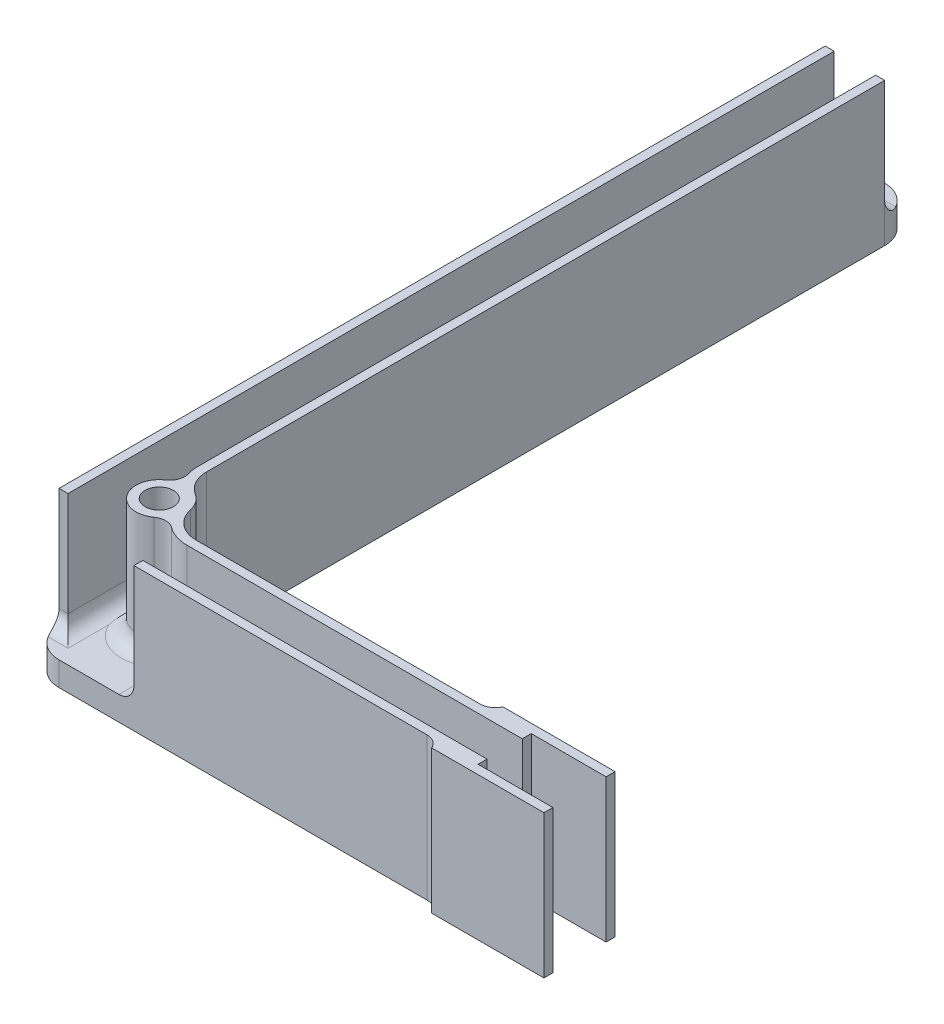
ISO-10303-21;
HEADER;
FILE_DESCRIPTION(('STEP AP214'),'2;1');
FILE_NAME('part.step','',(''),(''),'','','');
FILE_SCHEMA(('AUTOMOTIVE_DESIGN { 1 0 10303 214 1 1 1 1 }'));
ENDSEC;
DATA;
#1=APPLICATION_CONTEXT('core data for automotive mechanical design processes');
#2=APPLICATION_PROTOCOL_DEFINITION('international standard','automotive_design',2000,#1);
#3=PRODUCT_CONTEXT('',#1,'mechanical');
#4=PRODUCT('Part','Part','',(#3));
#5=PRODUCT_RELATED_PRODUCT_CATEGORY('part','',(#4));
#6=PRODUCT_DEFINITION_FORMATION('','',#4);
#7=PRODUCT_DEFINITION_CONTEXT('part definition',#1,'design');
#8=PRODUCT_DEFINITION('design','',#6,#7);
#9=PRODUCT_DEFINITION_SHAPE('','',#8);
#10=(LENGTH_UNIT() NAMED_UNIT(*) SI_UNIT(.MILLI.,.METRE.));
#11=(NAMED_UNIT(*) PLANE_ANGLE_UNIT() SI_UNIT($,.RADIAN.));
#12=(NAMED_UNIT(*) SI_UNIT($,.STERADIAN.) SOLID_ANGLE_UNIT());
#13=UNCERTAINTY_MEASURE_WITH_UNIT(LENGTH_MEASURE(1.E-05),#10,'distance_accuracy_value','');
#14=(GEOMETRIC_REPRESENTATION_CONTEXT(3) GLOBAL_UNCERTAINTY_ASSIGNED_CONTEXT((#13)) GLOBAL_UNIT_ASSIGNED_CONTEXT((#10,
#11,#12)) REPRESENTATION_CONTEXT('',''));
#15=CARTESIAN_POINT('',(0.,0.,0.));
#16=DIRECTION('',(0.,0.,1.));
#17=DIRECTION('',(1.,0.,0.));
#18=AXIS2_PLACEMENT_3D('',#15,#16,#17);
#19=CARTESIAN_POINT('',(0.,24.13,69.8669359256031));
#20=DIRECTION('',(0.,0.,1.));
#21=DIRECTION('',(1.,0.,0.));
#22=AXIS2_PLACEMENT_3D('',#19,#20,#21);
#23=PLANE('',#22);
#24=DIRECTION('',(0.,-1.,0.));
#25=VECTOR('',#24,1.);
#26=CARTESIAN_POINT('',(-152.674614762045,24.13,69.8669359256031));
#27=LINE('',#26,#25);
#28=CARTESIAN_POINT('',(-152.674614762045,3.92812399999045,69.8669359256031));
#29=VERTEX_POINT('',#28);
#30=CARTESIAN_POINT('',(-152.674614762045,-0.161276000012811,69.8669359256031));
#31=VERTEX_POINT('',#30);
#32=EDGE_CURVE('E504',#29,#31,#27,.T.);
#33=ORIENTED_EDGE('',*,*,#32,.T.);
#34=DIRECTION('',(-1.,0.,0.));
#35=VECTOR('',#34,1.);
#36=CARTESIAN_POINT('',(-90.2546447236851,-0.161276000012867,69.8669359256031));
#37=LINE('',#36,#35);
#38=CARTESIAN_POINT('',(-90.2546447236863,-0.161276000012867,69.8669359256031));
#39=VERTEX_POINT('',#38);
#40=EDGE_CURVE('E374',#39,#31,#37,.T.);
#41=ORIENTED_EDGE('',*,*,#40,.F.);
#42=DIRECTION('',(0.,1.,0.));
#43=VECTOR('',#42,1.);
#44=CARTESIAN_POINT('',(-90.2546447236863,24.1300000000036,69.8669359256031));
#45=LINE('',#44,#43);
#46=CARTESIAN_POINT('',(-90.2546447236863,24.13,69.8669359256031));
#47=VERTEX_POINT('',#46);
#48=EDGE_CURVE('E72',#39,#47,#45,.T.);
#49=ORIENTED_EDGE('',*,*,#48,.T.);
#50=DIRECTION('',(-1.,0.,0.));
#51=VECTOR('',#50,1.);
#52=CARTESIAN_POINT('',(0.,24.13,69.8669359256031));
#53=LINE('',#52,#51);
#54=CARTESIAN_POINT('',(-139.974614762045,24.13,69.8669359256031));
#55=VERTEX_POINT('',#54);
#56=EDGE_CURVE('E498',#47,#55,#53,.T.);
#57=ORIENTED_EDGE('',*,*,#56,.T.);
#58=DIRECTION('',(0.,1.,0.));
#59=VECTOR('',#58,1.);
#60=CARTESIAN_POINT('',(-139.974614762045,-14.4645375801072,69.8669359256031));
#61=LINE('',#60,#59);
#62=CARTESIAN_POINT('',(-139.974614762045,6.46812399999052,69.8669359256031));
#63=VERTEX_POINT('',#62);
#64=EDGE_CURVE('E446',#63,#55,#61,.T.);
#65=ORIENTED_EDGE('',*,*,#64,.F.);
#66=CARTESIAN_POINT('',(-142.514614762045,6.46812399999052,69.8669359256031));
#67=DIRECTION('',(0.,0.,1.));
#68=DIRECTION('',(1.,0.,0.));
#69=AXIS2_PLACEMENT_3D('',#66,#67,#68);
#70=CIRCLE('',#69,2.54);
#71=CARTESIAN_POINT('',(-142.514614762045,3.92812399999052,69.8669359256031));
#72=VERTEX_POINT('',#71);
#73=EDGE_CURVE('E603',#63,#72,#70,.F.);
#74=ORIENTED_EDGE('',*,*,#73,.T.);
#75=DIRECTION('',(1.,0.,0.));
#76=VECTOR('',#75,1.);
#77=CARTESIAN_POINT('',(-1.28434399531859E-13,3.92812399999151,69.8669359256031));
#78=LINE('',#77,#76);
#79=EDGE_CURVE('E443',#29,#72,#78,.T.);
#80=ORIENTED_EDGE('',*,*,#79,.F.);
#81=EDGE_LOOP('',(#33,#41,#49,#57,#65,#74,#80));
#82=FACE_BOUND('',#81,.T.);
#83=ADVANCED_FACE('F51',(#82),#23,.T.);
#84=CARTESIAN_POINT('',(0.,24.13,60.8439918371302));
#85=DIRECTION('',(0.,0.,-1.));
#86=DIRECTION('',(-1.,0.,0.));
#87=AXIS2_PLACEMENT_3D('',#84,#85,#86);
#88=PLANE('',#87);
#89=DIRECTION('',(1.,0.,0.));
#90=VECTOR('',#89,1.);
#91=CARTESIAN_POINT('',(0.,24.13,60.8439918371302));
#92=LINE('',#91,#90);
#93=CARTESIAN_POINT('',(-138.474637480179,24.13,60.8439918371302));
#94=VERTEX_POINT('',#93);
#95=CARTESIAN_POINT('',(-90.2546447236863,24.13,60.8439918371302));
#96=VERTEX_POINT('',#95);
#97=EDGE_CURVE('E500',#94,#96,#92,.T.);
#98=ORIENTED_EDGE('',*,*,#97,.T.);
#99=DIRECTION('',(0.,-1.,0.));
#100=VECTOR('',#99,1.);
#101=CARTESIAN_POINT('',(-90.2546447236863,1.13412399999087,60.8439918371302));
#102=LINE('',#101,#100);
#103=CARTESIAN_POINT('',(-90.2546447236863,-0.161276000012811,60.8439918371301));
#104=VERTEX_POINT('',#103);
#105=EDGE_CURVE('E641',#96,#104,#102,.T.);
#106=ORIENTED_EDGE('',*,*,#105,.T.);
#107=DIRECTION('',(1.,0.,0.));
#108=VECTOR('',#107,1.);
#109=CARTESIAN_POINT('',(-138.474637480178,-0.161276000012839,60.84399183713));
#110=LINE('',#109,#108);
#111=CARTESIAN_POINT('',(-138.474637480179,-0.161276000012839,60.8439918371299));
#112=VERTEX_POINT('',#111);
#113=EDGE_CURVE('E350',#112,#104,#110,.T.);
#114=ORIENTED_EDGE('',*,*,#113,.F.);
#115=DIRECTION('',(0.,-1.,0.));
#116=VECTOR('',#115,1.);
#117=CARTESIAN_POINT('',(-138.474637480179,24.13,60.8439918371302));
#118=LINE('',#117,#116);
#119=EDGE_CURVE('E502',#94,#112,#118,.T.);
#120=ORIENTED_EDGE('',*,*,#119,.F.);
#121=EDGE_LOOP('',(#98,#106,#114,#120));
#122=FACE_BOUND('',#121,.T.);
#123=ADVANCED_FACE('F623',(#122),#88,.T.);
#124=CARTESIAN_POINT('',(-152.743981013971,3.92812399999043,64.8153031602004));
#125=DIRECTION('',(0.,-1.,0.));
#126=DIRECTION('',(1.,0.,0.));
#127=AXIS2_PLACEMENT_3D('',#124,#125,#126);
#128=PLANE('',#127);
#129=DIRECTION('',(1.,0.,0.));
#130=VECTOR('',#129,1.);
#131=CARTESIAN_POINT('',(-10.0860452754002,3.92812399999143,65.8029359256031));
#132=LINE('',#131,#130);
#133=CARTESIAN_POINT('',(-142.514614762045,3.9281239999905,65.8029359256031));
#134=VERTEX_POINT('',#133);
#135=CARTESIAN_POINT('',(-81.5766962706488,3.92812399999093,65.8029359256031));
#136=VERTEX_POINT('',#135);
#137=EDGE_CURVE('E848',#134,#136,#132,.T.);
#138=ORIENTED_EDGE('',*,*,#137,.T.);
#139=DIRECTION('',(0.,0.,-1.));
#140=VECTOR('',#139,1.);
#141=CARTESIAN_POINT('',(-81.5766962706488,3.92812399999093,64.8153031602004));
#142=LINE('',#141,#140);
#143=CARTESIAN_POINT('',(-81.5766962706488,3.92812399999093,64.9079918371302));
#144=VERTEX_POINT('',#143);
#145=EDGE_CURVE('E424',#136,#144,#142,.T.);
#146=ORIENTED_EDGE('',*,*,#145,.T.);
#147=DIRECTION('',(-1.,0.,0.));
#148=VECTOR('',#147,1.);
#149=CARTESIAN_POINT('',(-138.474637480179,3.92812399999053,64.9079918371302));
#150=LINE('',#149,#148);
#151=CARTESIAN_POINT('',(-138.474637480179,3.92812399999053,64.9079918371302));
#152=VERTEX_POINT('',#151);
#153=EDGE_CURVE('E850',#144,#152,#150,.T.);
#154=ORIENTED_EDGE('',*,*,#153,.T.);
#155=CARTESIAN_POINT('',(-138.474637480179,3.9281239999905,55.8439918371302));
#156=DIRECTION('',(0.,-1.,0.));
#157=DIRECTION('',(1.,0.,0.));
#158=AXIS2_PLACEMENT_3D('',#155,#156,#157);
#159=CIRCLE('',#158,9.06399999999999);
#160=CARTESIAN_POINT('',(-143.886683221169,3.92812399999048,63.1148829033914));
#161=VERTEX_POINT('',#160);
#162=EDGE_CURVE('E853',#152,#161,#159,.T.);
#163=ORIENTED_EDGE('',*,*,#162,.T.);
#164=CARTESIAN_POINT('',(-147.674614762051,3.92812399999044,57.8669359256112));
#165=DIRECTION('',(0.,-1.,0.));
#166=DIRECTION('',(1.,0.,0.));
#167=AXIS2_PLACEMENT_3D('',#164,#165,#166);
#168=CIRCLE('',#167,6.47219999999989);
#169=CARTESIAN_POINT('',(-153.610614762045,3.92812399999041,60.4463305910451));
#170=VERTEX_POINT('',#169);
#171=EDGE_CURVE('E890',#161,#170,#168,.T.);
#172=ORIENTED_EDGE('',*,*,#171,.T.);
#173=DIRECTION('',(0.,0.,1.));
#174=VECTOR('',#173,1.);
#175=CARTESIAN_POINT('',(-153.610614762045,3.92812399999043,67.4069359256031));
#176=LINE('',#175,#174);
#177=CARTESIAN_POINT('',(-153.610614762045,3.92812399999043,67.4069359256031));
#178=VERTEX_POINT('',#177);
#179=EDGE_CURVE('E887',#170,#178,#176,.T.);
#180=ORIENTED_EDGE('',*,*,#179,.T.);
#181=DIRECTION('',(-1.,0.,0.));
#182=VECTOR('',#181,1.);
#183=CARTESIAN_POINT('',(-157.674614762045,3.9281239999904,67.4069359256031));
#184=LINE('',#183,#182);
#185=CARTESIAN_POINT('',(-156.981400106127,3.92812399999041,67.4069359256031));
#186=VERTEX_POINT('',#185);
#187=EDGE_CURVE('E831',#178,#186,#184,.T.);
#188=ORIENTED_EDGE('',*,*,#187,.T.);
#189=CARTESIAN_POINT('',(-152.674614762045,3.92812399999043,64.8669359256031));
#190=DIRECTION('',(0.,-1.,0.));
#191=DIRECTION('',(1.,0.,0.));
#192=AXIS2_PLACEMENT_3D('',#189,#190,#191);
#193=CIRCLE('',#192,5.);
#194=EDGE_CURVE('E441',#186,#29,#193,.F.);
#195=ORIENTED_EDGE('',*,*,#194,.T.);
#196=ORIENTED_EDGE('',*,*,#79,.T.);
#197=DIRECTION('',(0.,0.,1.));
#198=VECTOR('',#197,1.);
#199=CARTESIAN_POINT('',(-142.514614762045,3.9281239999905,64.8153031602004));
#200=LINE('',#199,#198);
#201=EDGE_CURVE('E826',#72,#134,#200,.F.);
#202=ORIENTED_EDGE('',*,*,#201,.T.);
#203=EDGE_LOOP('',(#138,#146,#154,#163,#172,#180,#188,#195,#196,#202));
#204=FACE_BOUND('',#203,.T.);
#205=ADVANCED_FACE('F628',(#204),#128,.F.);
#206=CARTESIAN_POINT('',(-147.674614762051,24.1300000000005,57.8669359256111));
#207=DIRECTION('',(0.,-1.,0.));
#208=DIRECTION('',(1.,0.,0.));
#209=AXIS2_PLACEMENT_3D('',#206,#207,#208);
#210=CYLINDRICAL_SURFACE('',#209,3.93219999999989);
#211=DIRECTION('',(0.,-1.,0.));
#212=VECTOR('',#211,1.);
#213=CARTESIAN_POINT('',(-149.86430101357,24.1300000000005,54.6008264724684));
#214=LINE('',#213,#212);
#215=CARTESIAN_POINT('',(-149.86430101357,24.13,54.6008264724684));
#216=VERTEX_POINT('',#215);
#217=CARTESIAN_POINT('',(-149.86430101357,6.46812399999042,54.6008264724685));
#218=VERTEX_POINT('',#217);
#219=EDGE_CURVE('E829',#216,#218,#214,.T.);
#220=ORIENTED_EDGE('',*,*,#219,.T.);
#221=CARTESIAN_POINT('',(-147.674614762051,6.46812399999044,57.8669359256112));
#222=DIRECTION('',(0.,-1.,0.));
#223=DIRECTION('',(1.,0.,0.));
#224=AXIS2_PLACEMENT_3D('',#221,#222,#223);
#225=CIRCLE('',#224,3.93219999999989);
#226=CARTESIAN_POINT('',(-145.37324823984,6.46812399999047,61.0553381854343));
#227=VERTEX_POINT('',#226);
#228=EDGE_CURVE('E679',#218,#227,#225,.F.);
#229=ORIENTED_EDGE('',*,*,#228,.T.);
#230=DIRECTION('',(0.,-1.,0.));
#231=VECTOR('',#230,1.);
#232=CARTESIAN_POINT('',(-145.37324823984,24.1300000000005,61.0553381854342));
#233=LINE('',#232,#231);
#234=CARTESIAN_POINT('',(-145.37324823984,24.13,61.0553381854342));
#235=VERTEX_POINT('',#234);
#236=EDGE_CURVE('E837',#227,#235,#233,.F.);
#237=ORIENTED_EDGE('',*,*,#236,.T.);
#238=CARTESIAN_POINT('',(-147.674614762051,24.13,57.8669359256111));
#239=DIRECTION('',(0.,-1.,0.));
#240=DIRECTION('',(0.,0.,1.));
#241=AXIS2_PLACEMENT_3D('',#238,#239,#240);
#242=CIRCLE('',#241,3.93219999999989);
#243=EDGE_CURVE('E467',#235,#216,#242,.T.);
#244=ORIENTED_EDGE('',*,*,#243,.T.);
#245=EDGE_LOOP('',(#220,#229,#237,#244));
#246=FACE_BOUND('',#245,.T.);
#247=ADVANCED_FACE('F573',(#246),#210,.T.);
#248=CARTESIAN_POINT('',(-142.5800452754,24.13,49.9437265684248));
#249=DIRECTION('',(0.,-1.,0.));
#250=DIRECTION('',(0.,0.,-1.));
#251=AXIS2_PLACEMENT_3D('',#248,#249,#250);
#252=CYLINDRICAL_SURFACE('',#251,6.52400000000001);
#253=DIRECTION('',(0.,1.,0.));
#254=VECTOR('',#253,1.);
#255=CARTESIAN_POINT('',(-149.1040452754,24.13,49.9437265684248));
#256=LINE('',#255,#254);
#257=CARTESIAN_POINT('',(-149.1040452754,24.13,49.9437265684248));
#258=VERTEX_POINT('',#257);
#259=CARTESIAN_POINT('',(-149.1040452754,6.46812399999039,49.9437265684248));
#260=VERTEX_POINT('',#259);
#261=EDGE_CURVE('E530',#258,#260,#256,.F.);
#262=ORIENTED_EDGE('',*,*,#261,.T.);
#263=CARTESIAN_POINT('',(-142.5800452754,6.46812399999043,49.9437265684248));
#264=DIRECTION('',(0.,-1.,0.));
#265=DIRECTION('',(1.,0.,0.));
#266=AXIS2_PLACEMENT_3D('',#263,#264,#265);
#267=CIRCLE('',#266,6.52400000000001);
#268=CARTESIAN_POINT('',(-148.841099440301,6.4681239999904,51.7772414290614));
#269=VERTEX_POINT('',#268);
#270=EDGE_CURVE('E681',#260,#269,#267,.F.);
#271=ORIENTED_EDGE('',*,*,#270,.T.);
#272=DIRECTION('',(0.,-1.,0.));
#273=VECTOR('',#272,1.);
#274=CARTESIAN_POINT('',(-148.841099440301,24.13,51.7772414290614));
#275=LINE('',#274,#273);
#276=CARTESIAN_POINT('',(-148.841099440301,24.13,51.7772414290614));
#277=VERTEX_POINT('',#276);
#278=EDGE_CURVE('E838',#269,#277,#275,.F.);
#279=ORIENTED_EDGE('',*,*,#278,.T.);
#280=CARTESIAN_POINT('',(-142.5800452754,24.13,49.9437265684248));
#281=DIRECTION('',(0.,-1.,0.));
#282=DIRECTION('',(0.,0.,1.));
#283=AXIS2_PLACEMENT_3D('',#280,#281,#282);
#284=CIRCLE('',#283,6.524);
#285=EDGE_CURVE('E470',#277,#258,#284,.T.);
#286=ORIENTED_EDGE('',*,*,#285,.T.);
#287=EDGE_LOOP('',(#262,#271,#279,#286));
#288=FACE_BOUND('',#287,.T.);
#289=ADVANCED_FACE('F857',(#288),#252,.T.);
#290=CARTESIAN_POINT('',(-156.150614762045,24.13,0.));
#291=DIRECTION('',(-1.,0.,0.));
#292=DIRECTION('',(0.,0.,1.));
#293=AXIS2_PLACEMENT_3D('',#290,#291,#292);
#294=PLANE('',#293);
#295=DIRECTION('',(0.,-1.,0.));
#296=VECTOR('',#295,1.);
#297=CARTESIAN_POINT('',(-156.150614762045,24.13,64.8669359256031));
#298=LINE('',#297,#296);
#299=CARTESIAN_POINT('',(-156.150614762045,24.13,64.8669359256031));
#300=VERTEX_POINT('',#299);
#301=CARTESIAN_POINT('',(-156.150614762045,6.46812399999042,64.8669359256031));
#302=VERTEX_POINT('',#301);
#303=EDGE_CURVE('E523',#300,#302,#298,.T.);
#304=ORIENTED_EDGE('',*,*,#303,.T.);
#305=DIRECTION('',(0.,0.,1.));
#306=VECTOR('',#305,1.);
#307=CARTESIAN_POINT('',(-156.150614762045,6.46812399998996,-67.6730640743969));
#308=LINE('',#307,#306);
#309=CARTESIAN_POINT('',(-156.150614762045,6.46812399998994,-65.133064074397));
#310=VERTEX_POINT('',#309);
#311=EDGE_CURVE('E686',#302,#310,#308,.F.);
#312=ORIENTED_EDGE('',*,*,#311,.T.);
#313=DIRECTION('',(0.,1.,0.));
#314=VECTOR('',#313,1.);
#315=CARTESIAN_POINT('',(-156.150614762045,-7.37917326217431,-65.133064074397));
#316=LINE('',#315,#314);
#317=CARTESIAN_POINT('',(-156.150614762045,24.13,-65.133064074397));
#318=VERTEX_POINT('',#317);
#319=EDGE_CURVE('E437',#310,#318,#316,.T.);
#320=ORIENTED_EDGE('',*,*,#319,.T.);
#321=DIRECTION('',(0.,0.,1.));
#322=VECTOR('',#321,1.);
#323=CARTESIAN_POINT('',(-156.150614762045,24.13,64.8669359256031));
#324=LINE('',#323,#322);
#325=EDGE_CURVE('E475',#318,#300,#324,.T.);
#326=ORIENTED_EDGE('',*,*,#325,.T.);
#327=EDGE_LOOP('',(#304,#312,#320,#326));
#328=FACE_BOUND('',#327,.T.);
#329=ADVANCED_FACE('F815',(#328),#294,.F.);
#330=CARTESIAN_POINT('',(-138.474637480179,24.13,55.8439918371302));
#331=DIRECTION('',(0.,-1.,0.));
#332=DIRECTION('',(0.,0.,-1.));
#333=AXIS2_PLACEMENT_3D('',#330,#331,#332);
#334=CYLINDRICAL_SURFACE('',#333,6.52399999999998);
#335=DIRECTION('',(0.,-1.,0.));
#336=VECTOR('',#335,1.);
#337=CARTESIAN_POINT('',(-142.370068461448,24.13,61.0773648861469));
#338=LINE('',#337,#336);
#339=CARTESIAN_POINT('',(-142.370068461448,24.13,61.0773648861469));
#340=VERTEX_POINT('',#339);
#341=CARTESIAN_POINT('',(-142.370068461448,6.46812399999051,61.0773648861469));
#342=VERTEX_POINT('',#341);
#343=EDGE_CURVE('E825',#340,#342,#338,.T.);
#344=ORIENTED_EDGE('',*,*,#343,.T.);
#345=CARTESIAN_POINT('',(-138.474637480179,6.46812399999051,55.8439918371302));
#346=DIRECTION('',(0.,-1.,0.));
#347=DIRECTION('',(1.,0.,0.));
#348=AXIS2_PLACEMENT_3D('',#345,#346,#347);
#349=CIRCLE('',#348,6.52399999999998);
#350=CARTESIAN_POINT('',(-138.474637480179,6.46812399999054,62.3679918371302));
#351=VERTEX_POINT('',#350);
#352=EDGE_CURVE('E849',#342,#351,#349,.F.);
#353=ORIENTED_EDGE('',*,*,#352,.T.);
#354=DIRECTION('',(0.,-1.,0.));
#355=VECTOR('',#354,1.);
#356=CARTESIAN_POINT('',(-138.474637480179,24.13,62.3679918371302));
#357=LINE('',#356,#355);
#358=CARTESIAN_POINT('',(-138.474637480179,24.13,62.3679918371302));
#359=VERTEX_POINT('',#358);
#360=EDGE_CURVE('E522',#359,#351,#357,.T.);
#361=ORIENTED_EDGE('',*,*,#360,.F.);
#362=CARTESIAN_POINT('',(-138.474637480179,24.13,55.8439918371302));
#363=DIRECTION('',(0.,-1.,0.));
#364=DIRECTION('',(0.,0.,1.));
#365=AXIS2_PLACEMENT_3D('',#362,#363,#364);
#366=CIRCLE('',#365,6.52399999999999);
#367=EDGE_CURVE('E464',#359,#340,#366,.T.);
#368=ORIENTED_EDGE('',*,*,#367,.T.);
#369=EDGE_LOOP('',(#344,#353,#361,#368));
#370=FACE_BOUND('',#369,.T.);
#371=ADVANCED_FACE('F796',(#370),#334,.T.);
#372=CARTESIAN_POINT('',(0.,24.13,0.));
#373=DIRECTION('',(0.,1.,0.));
#374=DIRECTION('',(0.,0.,1.));
#375=AXIS2_PLACEMENT_3D('',#372,#373,#374);
#376=PLANE('',#375);
#377=DIRECTION('',(0.,0.,-1.));
#378=VECTOR('',#377,1.);
#379=CARTESIAN_POINT('',(-81.5766962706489,24.1300000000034,0.));
#380=LINE('',#379,#378);
#381=CARTESIAN_POINT('',(-81.5766962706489,24.1300000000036,69.8669359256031));
#382=VERTEX_POINT('',#381);
#383=CARTESIAN_POINT('',(-81.5766962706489,24.1300000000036,68.3429359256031));
#384=VERTEX_POINT('',#383);
#385=EDGE_CURVE('E415',#382,#384,#380,.T.);
#386=ORIENTED_EDGE('',*,*,#385,.T.);
#387=DIRECTION('',(1.,0.,0.));
#388=VECTOR('',#387,1.);
#389=CARTESIAN_POINT('',(150.140385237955,24.13,68.342935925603));
#390=LINE('',#389,#388);
#391=CARTESIAN_POINT('',(-139.974614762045,24.13,68.342935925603));
#392=VERTEX_POINT('',#391);
#393=EDGE_CURVE('E478',#392,#384,#390,.T.);
#394=ORIENTED_EDGE('',*,*,#393,.F.);
#395=DIRECTION('',(0.,0.,1.));
#396=VECTOR('',#395,1.);
#397=CARTESIAN_POINT('',(-139.974614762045,24.13,0.));
#398=LINE('',#397,#396);
#399=EDGE_CURVE('E434',#392,#55,#398,.T.);
#400=ORIENTED_EDGE('',*,*,#399,.T.);
#401=ORIENTED_EDGE('',*,*,#56,.F.);
#402=CARTESIAN_POINT('',(-90.2546447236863,24.13,72.4069359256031));
#403=DIRECTION('',(0.,1.,0.));
#404=DIRECTION('',(0.,0.,1.));
#405=AXIS2_PLACEMENT_3D('',#402,#403,#404);
#406=CIRCLE('',#405,2.54);
#407=CARTESIAN_POINT('',(-87.9266962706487,24.1300000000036,71.3909359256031));
#408=VERTEX_POINT('',#407);
#409=EDGE_CURVE('E59',#47,#408,#406,.F.);
#410=ORIENTED_EDGE('',*,*,#409,.T.);
#411=DIRECTION('',(-1.,0.,0.));
#412=VECTOR('',#411,1.);
#413=CARTESIAN_POINT('',(-68.8766962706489,24.1300000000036,71.3909359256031));
#414=LINE('',#413,#412);
#415=CARTESIAN_POINT('',(-68.8766962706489,24.1300000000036,71.3909359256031));
#416=VERTEX_POINT('',#415);
#417=EDGE_CURVE('E393',#416,#408,#414,.T.);
#418=ORIENTED_EDGE('',*,*,#417,.F.);
#419=DIRECTION('',(0.,0.,-1.));
#420=VECTOR('',#419,1.);
#421=CARTESIAN_POINT('',(-68.8766962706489,24.1300000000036,71.3909359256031));
#422=LINE('',#421,#420);
#423=CARTESIAN_POINT('',(-68.8766962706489,24.1300000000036,69.8669359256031));
#424=VERTEX_POINT('',#423);
#425=EDGE_CURVE('E399',#416,#424,#422,.T.);
#426=ORIENTED_EDGE('',*,*,#425,.T.);
#427=DIRECTION('',(-1.,0.,0.));
#428=VECTOR('',#427,1.);
#429=CARTESIAN_POINT('',(-68.8766962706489,24.1300000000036,69.8669359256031));
#430=LINE('',#429,#428);
#431=EDGE_CURVE('E394',#424,#382,#430,.T.);
#432=ORIENTED_EDGE('',*,*,#431,.T.);
#433=EDGE_LOOP('',(#386,#394,#400,#401,#410,#418,#426,#432));
#434=FACE_BOUND('',#433,.T.);
#435=ADVANCED_FACE('F650',(#434),#376,.T.);
#436=CARTESIAN_POINT('',(0.,24.13,68.3429359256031));
#437=DIRECTION('',(0.,0.,1.));
#438=DIRECTION('',(1.,0.,0.));
#439=AXIS2_PLACEMENT_3D('',#436,#437,#438);
#440=PLANE('',#439);
#441=ORIENTED_EDGE('',*,*,#393,.T.);
#442=DIRECTION('',(0.,-1.,0.));
#443=VECTOR('',#442,1.);
#444=CARTESIAN_POINT('',(-81.5766962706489,24.1299999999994,68.3429359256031));
#445=LINE('',#444,#443);
#446=CARTESIAN_POINT('',(-81.5766962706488,6.46812399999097,68.3429359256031));
#447=VERTEX_POINT('',#446);
#448=EDGE_CURVE('E420',#384,#447,#445,.T.);
#449=ORIENTED_EDGE('',*,*,#448,.T.);
#450=DIRECTION('',(1.,0.,0.));
#451=VECTOR('',#450,1.);
#452=CARTESIAN_POINT('',(-142.514614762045,6.4681239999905,68.3429359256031));
#453=LINE('',#452,#451);
#454=CARTESIAN_POINT('',(-139.974614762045,6.46812399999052,68.342935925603));
#455=VERTEX_POINT('',#454);
#456=EDGE_CURVE('E666',#447,#455,#453,.F.);
#457=ORIENTED_EDGE('',*,*,#456,.T.);
#458=DIRECTION('',(0.,1.,0.));
#459=VECTOR('',#458,1.);
#460=CARTESIAN_POINT('',(-139.974614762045,-14.4645375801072,68.342935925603));
#461=LINE('',#460,#459);
#462=EDGE_CURVE('E438',#455,#392,#461,.T.);
#463=ORIENTED_EDGE('',*,*,#462,.T.);
#464=EDGE_LOOP('',(#441,#449,#457,#463));
#465=FACE_BOUND('',#464,.T.);
#466=ADVANCED_FACE('F665',(#465),#440,.F.);
#467=DIRECTION('',(-1.,0.,0.));
#468=VECTOR('',#467,1.);
#469=CARTESIAN_POINT('',(0.,24.13,64.8669359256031));
#470=LINE('',#469,#468);
#471=CARTESIAN_POINT('',(-157.674614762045,24.13,64.8669359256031));
#472=VERTEX_POINT('',#471);
#473=EDGE_CURVE('E439',#300,#472,#470,.T.);
#474=ORIENTED_EDGE('',*,*,#473,.F.);
#475=ORIENTED_EDGE('',*,*,#325,.F.);
#476=DIRECTION('',(1.,0.,0.));
#477=VECTOR('',#476,1.);
#478=CARTESIAN_POINT('',(-156.150614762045,24.13,-65.133064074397));
#479=LINE('',#478,#477);
#480=CARTESIAN_POINT('',(-157.674614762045,24.13,-65.1330640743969));
#481=VERTEX_POINT('',#480);
#482=EDGE_CURVE('E457',#481,#318,#479,.T.);
#483=ORIENTED_EDGE('',*,*,#482,.F.);
#484=DIRECTION('',(0.,0.,-1.));
#485=VECTOR('',#484,1.);
#486=CARTESIAN_POINT('',(-157.674614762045,24.13,0.));
#487=LINE('',#486,#485);
#488=EDGE_CURVE('E495',#472,#481,#487,.T.);
#489=ORIENTED_EDGE('',*,*,#488,.F.);
#490=EDGE_LOOP('',(#474,#475,#483,#489));
#491=FACE_BOUND('',#490,.T.);
#492=ADVANCED_FACE('F790',(#491),#376,.T.);
#493=DIRECTION('',(0.,0.,-1.));
#494=VECTOR('',#493,1.);
#495=CARTESIAN_POINT('',(-151.6440452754,3.92812399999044,64.8153031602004));
#496=LINE('',#495,#494);
#497=CARTESIAN_POINT('',(-151.6440452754,3.92812399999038,49.9437265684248));
#498=VERTEX_POINT('',#497);
#499=CARTESIAN_POINT('',(-151.6440452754,3.92812399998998,-67.6730640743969));
#500=VERTEX_POINT('',#499);
#501=EDGE_CURVE('E884',#498,#500,#496,.T.);
#502=ORIENTED_EDGE('',*,*,#501,.T.);
#503=DIRECTION('',(1.,0.,0.));
#504=VECTOR('',#503,1.);
#505=CARTESIAN_POINT('',(-147.5800452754,3.92812399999,-67.6730640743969));
#506=LINE('',#505,#504);
#507=CARTESIAN_POINT('',(-148.258390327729,3.92812399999,-67.6730640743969));
#508=VERTEX_POINT('',#507);
#509=EDGE_CURVE('E526',#500,#508,#506,.T.);
#510=ORIENTED_EDGE('',*,*,#509,.T.);
#511=CARTESIAN_POINT('',(-152.674614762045,3.92812399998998,-65.133064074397));
#512=DIRECTION('',(0.,-1.,0.));
#513=DIRECTION('',(1.,0.,0.));
#514=AXIS2_PLACEMENT_3D('',#511,#512,#513);
#515=CIRCLE('',#514,5.0945694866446);
#516=CARTESIAN_POINT('',(-157.090839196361,3.92812399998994,-67.6730640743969));
#517=VERTEX_POINT('',#516);
#518=EDGE_CURVE('E453',#508,#517,#515,.F.);
#519=ORIENTED_EDGE('',*,*,#518,.T.);
#520=DIRECTION('',(1.,0.,0.));
#521=VECTOR('',#520,1.);
#522=CARTESIAN_POINT('',(-156.150614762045,3.92812399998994,-67.6730640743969));
#523=LINE('',#522,#521);
#524=CARTESIAN_POINT('',(-153.610614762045,3.92812399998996,-67.6730640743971));
#525=VERTEX_POINT('',#524);
#526=EDGE_CURVE('E537',#517,#525,#523,.T.);
#527=ORIENTED_EDGE('',*,*,#526,.T.);
#528=DIRECTION('',(0.,0.,1.));
#529=VECTOR('',#528,1.);
#530=CARTESIAN_POINT('',(-153.610614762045,3.92812399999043,67.4069359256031));
#531=LINE('',#530,#529);
#532=CARTESIAN_POINT('',(-153.610614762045,3.92812399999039,55.2875412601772));
#533=VERTEX_POINT('',#532);
#534=EDGE_CURVE('E874',#525,#533,#531,.T.);
#535=ORIENTED_EDGE('',*,*,#534,.T.);
#536=CARTESIAN_POINT('',(-147.674614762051,3.92812399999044,57.8669359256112));
#537=DIRECTION('',(0.,-1.,0.));
#538=DIRECTION('',(1.,0.,0.));
#539=AXIS2_PLACEMENT_3D('',#536,#537,#538);
#540=CIRCLE('',#539,6.47219999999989);
#541=CARTESIAN_POINT('',(-151.278726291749,3.9281239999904,52.4910868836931));
#542=VERTEX_POINT('',#541);
#543=EDGE_CURVE('E877',#533,#542,#540,.T.);
#544=ORIENTED_EDGE('',*,*,#543,.T.);
#545=CARTESIAN_POINT('',(-142.5800452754,3.92812399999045,49.9437265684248));
#546=DIRECTION('',(0.,-1.,0.));
#547=DIRECTION('',(1.,0.,0.));
#548=AXIS2_PLACEMENT_3D('',#545,#546,#547);
#549=CIRCLE('',#548,9.06400000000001);
#550=EDGE_CURVE('E871',#542,#498,#549,.T.);
#551=ORIENTED_EDGE('',*,*,#550,.T.);
#552=EDGE_LOOP('',(#502,#510,#519,#527,#535,#544,#551));
#553=FACE_BOUND('',#552,.T.);
#554=ADVANCED_FACE('F798',(#553),#128,.F.);
#555=CARTESIAN_POINT('',(-149.1040452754,24.13,0.));
#556=DIRECTION('',(-1.,0.,0.));
#557=DIRECTION('',(0.,0.,1.));
#558=AXIS2_PLACEMENT_3D('',#555,#556,#557);
#559=PLANE('',#558);
#560=DIRECTION('',(0.,-1.,0.));
#561=VECTOR('',#560,1.);
#562=CARTESIAN_POINT('',(-149.1040452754,24.13,-65.133064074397));
#563=LINE('',#562,#561);
#564=CARTESIAN_POINT('',(-149.1040452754,24.13,-65.133064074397));
#565=VERTEX_POINT('',#564);
#566=CARTESIAN_POINT('',(-149.1040452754,6.46812399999,-65.133064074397));
#567=VERTEX_POINT('',#566);
#568=EDGE_CURVE('E527',#565,#567,#563,.T.);
#569=ORIENTED_EDGE('',*,*,#568,.T.);
#570=DIRECTION('',(0.,0.,-1.));
#571=VECTOR('',#570,1.);
#572=CARTESIAN_POINT('',(-149.1040452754,6.46812399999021,0.));
#573=LINE('',#572,#571);
#574=EDGE_CURVE('E676',#567,#260,#573,.F.);
#575=ORIENTED_EDGE('',*,*,#574,.T.);
#576=ORIENTED_EDGE('',*,*,#261,.F.);
#577=DIRECTION('',(0.,0.,-1.));
#578=VECTOR('',#577,1.);
#579=CARTESIAN_POINT('',(-149.1040452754,24.13,49.9437265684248));
#580=LINE('',#579,#578);
#581=EDGE_CURVE('E472',#258,#565,#580,.T.);
#582=ORIENTED_EDGE('',*,*,#581,.T.);
#583=EDGE_LOOP('',(#569,#575,#576,#582));
#584=FACE_BOUND('',#583,.T.);
#585=ADVANCED_FACE('F804',(#584),#559,.T.);
#586=CARTESIAN_POINT('',(0.,24.13,62.3679918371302));
#587=DIRECTION('',(0.,0.,-1.));
#588=DIRECTION('',(-1.,0.,0.));
#589=AXIS2_PLACEMENT_3D('',#586,#587,#588);
#590=PLANE('',#589);
#591=DIRECTION('',(-1.,0.,0.));
#592=VECTOR('',#591,1.);
#593=CARTESIAN_POINT('',(-15.3400452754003,6.46812399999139,62.3679918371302));
#594=LINE('',#593,#592);
#595=CARTESIAN_POINT('',(-81.5766962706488,6.46812399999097,62.3679918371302));
#596=VERTEX_POINT('',#595);
#597=EDGE_CURVE('E675',#351,#596,#594,.F.);
#598=ORIENTED_EDGE('',*,*,#597,.T.);
#599=DIRECTION('',(0.,1.,0.));
#600=VECTOR('',#599,1.);
#601=CARTESIAN_POINT('',(-81.5766962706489,24.1299999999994,62.3679918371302));
#602=LINE('',#601,#600);
#603=CARTESIAN_POINT('',(-81.5766962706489,24.1300000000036,62.3679918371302));
#604=VERTEX_POINT('',#603);
#605=EDGE_CURVE('E430',#596,#604,#602,.T.);
#606=ORIENTED_EDGE('',*,*,#605,.T.);
#607=DIRECTION('',(-1.,0.,0.));
#608=VECTOR('',#607,1.);
#609=CARTESIAN_POINT('',(-138.474637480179,24.13,62.3679918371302));
#610=LINE('',#609,#608);
#611=EDGE_CURVE('E460',#604,#359,#610,.T.);
#612=ORIENTED_EDGE('',*,*,#611,.T.);
#613=ORIENTED_EDGE('',*,*,#360,.T.);
#614=EDGE_LOOP('',(#598,#606,#612,#613));
#615=FACE_BOUND('',#614,.T.);
#616=ADVANCED_FACE('F949',(#615),#590,.F.);
#617=CARTESIAN_POINT('',(-138.474637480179,24.13,55.8439918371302));
#618=DIRECTION('',(0.,-1.,0.));
#619=DIRECTION('',(0.,0.,-1.));
#620=AXIS2_PLACEMENT_3D('',#617,#618,#619);
#621=CYLINDRICAL_SURFACE('',#620,4.99999999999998);
#622=ORIENTED_EDGE('',*,*,#119,.T.);
#623=CARTESIAN_POINT('',(-138.474637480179,-0.161276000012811,55.8439918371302));
#624=DIRECTION('',(0.,-1.,0.));
#625=DIRECTION('',(0.,0.,-1.));
#626=AXIS2_PLACEMENT_3D('',#623,#624,#625);
#627=CIRCLE('',#626,4.99999999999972);
#628=CARTESIAN_POINT('',(-143.357976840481,-0.161276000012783,56.917768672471));
#629=VERTEX_POINT('',#628);
#630=EDGE_CURVE('E353',#629,#112,#627,.F.);
#631=ORIENTED_EDGE('',*,*,#630,.F.);
#632=DIRECTION('',(0.,-1.,0.));
#633=VECTOR('',#632,1.);
#634=CARTESIAN_POINT('',(-143.357976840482,24.13,56.9177686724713));
#635=LINE('',#634,#633);
#636=CARTESIAN_POINT('',(-143.357976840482,24.13,56.9177686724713));
#637=VERTEX_POINT('',#636);
#638=EDGE_CURVE('E520',#637,#629,#635,.T.);
#639=ORIENTED_EDGE('',*,*,#638,.F.);
#640=CARTESIAN_POINT('',(-138.474637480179,24.13,55.8439918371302));
#641=DIRECTION('',(0.,1.,0.));
#642=DIRECTION('',(0.,0.,1.));
#643=AXIS2_PLACEMENT_3D('',#640,#641,#642);
#644=CIRCLE('',#643,4.99999999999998);
#645=EDGE_CURVE('E484',#637,#94,#644,.T.);
#646=ORIENTED_EDGE('',*,*,#645,.T.);
#647=EDGE_LOOP('',(#622,#631,#639,#646));
#648=FACE_BOUND('',#647,.T.);
#649=ADVANCED_FACE('F944',(#648),#621,.F.);
#650=CARTESIAN_POINT('',(-147.674614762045,24.13,57.8669359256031));
#651=DIRECTION('',(0.,-1.,0.));
#652=DIRECTION('',(0.,0.,-1.));
#653=AXIS2_PLACEMENT_3D('',#650,#651,#652);
#654=CYLINDRICAL_SURFACE('',#653,4.41976033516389);
#655=ORIENTED_EDGE('',*,*,#638,.T.);
#656=CARTESIAN_POINT('',(-147.674614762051,-0.161276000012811,57.8669359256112));
#657=DIRECTION('',(0.,-1.,0.));
#658=DIRECTION('',(0.,0.,-1.));
#659=AXIS2_PLACEMENT_3D('',#656,#657,#658);
#660=CIRCLE('',#659,4.41976033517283);
#661=CARTESIAN_POINT('',(-145.284238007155,-0.161276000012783,54.1493587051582));
#662=VERTEX_POINT('',#661);
#663=EDGE_CURVE('E356',#662,#629,#660,.T.);
#664=ORIENTED_EDGE('',*,*,#663,.F.);
#665=DIRECTION('',(0.,-1.,0.));
#666=VECTOR('',#665,1.);
#667=CARTESIAN_POINT('',(-145.284238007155,24.13,54.1493587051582));
#668=LINE('',#667,#666);
#669=CARTESIAN_POINT('',(-145.284238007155,24.13,54.1493587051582));
#670=VERTEX_POINT('',#669);
#671=EDGE_CURVE('E518',#670,#662,#668,.T.);
#672=ORIENTED_EDGE('',*,*,#671,.F.);
#673=CARTESIAN_POINT('',(-147.674614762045,24.13,57.8669359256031));
#674=DIRECTION('',(0.,1.,0.));
#675=DIRECTION('',(0.,0.,1.));
#676=AXIS2_PLACEMENT_3D('',#673,#674,#675);
#677=CIRCLE('',#676,4.41976033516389);
#678=EDGE_CURVE('E487',#637,#670,#677,.T.);
#679=ORIENTED_EDGE('',*,*,#678,.F.);
#680=EDGE_LOOP('',(#655,#664,#672,#679));
#681=FACE_BOUND('',#680,.T.);
#682=ADVANCED_FACE('F940',(#681),#654,.T.);
#683=CARTESIAN_POINT('',(-142.5800452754,24.13,49.9437265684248));
#684=DIRECTION('',(0.,-1.,0.));
#685=DIRECTION('',(0.,0.,-1.));
#686=AXIS2_PLACEMENT_3D('',#683,#684,#685);
#687=CYLINDRICAL_SURFACE('',#686,5.00000000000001);
#688=ORIENTED_EDGE('',*,*,#671,.T.);
#689=CARTESIAN_POINT('',(-142.5800452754,-0.161276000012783,49.9437265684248));
#690=DIRECTION('',(0.,-1.,0.));
#691=DIRECTION('',(0.,0.,-1.));
#692=AXIS2_PLACEMENT_3D('',#689,#690,#691);
#693=CIRCLE('',#692,5.00000000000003);
#694=CARTESIAN_POINT('',(-147.5800452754,-0.161276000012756,49.9437265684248));
#695=VERTEX_POINT('',#694);
#696=EDGE_CURVE('E359',#695,#662,#693,.F.);
#697=ORIENTED_EDGE('',*,*,#696,.F.);
#698=DIRECTION('',(0.,-1.,0.));
#699=VECTOR('',#698,1.);
#700=CARTESIAN_POINT('',(-147.5800452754,24.13,49.9437265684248));
#701=LINE('',#700,#699);
#702=CARTESIAN_POINT('',(-147.5800452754,24.13,49.9437265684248));
#703=VERTEX_POINT('',#702);
#704=EDGE_CURVE('E516',#703,#695,#701,.T.);
#705=ORIENTED_EDGE('',*,*,#704,.F.);
#706=CARTESIAN_POINT('',(-142.5800452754,24.13,49.9437265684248));
#707=DIRECTION('',(0.,1.,0.));
#708=DIRECTION('',(0.,0.,1.));
#709=AXIS2_PLACEMENT_3D('',#706,#707,#708);
#710=CIRCLE('',#709,5.00000000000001);
#711=EDGE_CURVE('E489',#703,#670,#710,.T.);
#712=ORIENTED_EDGE('',*,*,#711,.T.);
#713=EDGE_LOOP('',(#688,#697,#705,#712));
#714=FACE_BOUND('',#713,.T.);
#715=ADVANCED_FACE('F935',(#714),#687,.F.);
#716=CARTESIAN_POINT('',(-147.5800452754,24.13,0.));
#717=DIRECTION('',(-1.,0.,0.));
#718=DIRECTION('',(0.,0.,1.));
#719=AXIS2_PLACEMENT_3D('',#716,#717,#718);
#720=PLANE('',#719);
#721=ORIENTED_EDGE('',*,*,#704,.T.);
#722=DIRECTION('',(0.,0.,1.));
#723=VECTOR('',#722,1.);
#724=CARTESIAN_POINT('',(-147.5800452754,-0.161276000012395,-65.1330640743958));
#725=LINE('',#724,#723);
#726=CARTESIAN_POINT('',(-147.5800452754,-0.161276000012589,-65.133064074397));
#727=VERTEX_POINT('',#726);
#728=EDGE_CURVE('E362',#727,#695,#725,.T.);
#729=ORIENTED_EDGE('',*,*,#728,.F.);
#730=DIRECTION('',(0.,-1.,0.));
#731=VECTOR('',#730,1.);
#732=CARTESIAN_POINT('',(-147.5800452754,24.13,-65.133064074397));
#733=LINE('',#732,#731);
#734=CARTESIAN_POINT('',(-147.5800452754,6.46812399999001,-65.133064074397));
#735=VERTEX_POINT('',#734);
#736=EDGE_CURVE('E512',#735,#727,#733,.T.);
#737=ORIENTED_EDGE('',*,*,#736,.F.);
#738=CARTESIAN_POINT('',(-147.5800452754,24.13,-65.133064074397));
#739=VERTEX_POINT('',#738);
#740=EDGE_CURVE('E513',#739,#735,#733,.T.);
#741=ORIENTED_EDGE('',*,*,#740,.F.);
#742=DIRECTION('',(0.,0.,-1.));
#743=VECTOR('',#742,1.);
#744=CARTESIAN_POINT('',(-147.5800452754,24.13,0.));
#745=LINE('',#744,#743);
#746=EDGE_CURVE('E492',#703,#739,#745,.T.);
#747=ORIENTED_EDGE('',*,*,#746,.F.);
#748=EDGE_LOOP('',(#721,#729,#737,#741,#747));
#749=FACE_BOUND('',#748,.T.);
#750=ADVANCED_FACE('F619',(#749),#720,.F.);
#751=CARTESIAN_POINT('',(-152.674614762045,24.13,-65.133064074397));
#752=DIRECTION('',(0.,-1.,0.));
#753=DIRECTION('',(0.,0.,-1.));
#754=AXIS2_PLACEMENT_3D('',#751,#752,#753);
#755=CYLINDRICAL_SURFACE('',#754,5.0945694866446);
#756=DIRECTION('',(0.,-1.,0.));
#757=VECTOR('',#756,1.);
#758=CARTESIAN_POINT('',(-157.674614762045,24.13,-66.110119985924));
#759=LINE('',#758,#757);
#760=CARTESIAN_POINT('',(-157.674614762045,4.46592376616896,-66.110119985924));
#761=VERTEX_POINT('',#760);
#762=CARTESIAN_POINT('',(-157.674614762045,-0.161276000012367,-66.110119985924));
#763=VERTEX_POINT('',#762);
#764=EDGE_CURVE('E510',#761,#763,#759,.T.);
#765=ORIENTED_EDGE('',*,*,#764,.F.);
#766=CARTESIAN_POINT('',(-157.674614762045,4.46592376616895,-66.1101199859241));
#767=CARTESIAN_POINT('',(-157.664280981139,4.42459839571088,-66.1630389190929));
#768=CARTESIAN_POINT('',(-157.652765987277,4.38550401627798,-66.217467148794));
#769=CARTESIAN_POINT('',(-157.627198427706,4.31196969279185,-66.3288051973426));
#770=CARTESIAN_POINT('',(-157.613146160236,4.27752920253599,-66.3857147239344));
#771=CARTESIAN_POINT('',(-157.582370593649,4.21357681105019,-66.501325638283));
#772=CARTESIAN_POINT('',(-157.565655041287,4.18405110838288,-66.5600214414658));
#773=CARTESIAN_POINT('',(-157.529434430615,4.12990738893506,-66.6787767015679));
#774=CARTESIAN_POINT('',(-157.509929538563,4.10528907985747,-66.7388360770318));
#775=CARTESIAN_POINT('',(-157.447135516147,4.03884687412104,-66.9202352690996));
#776=CARTESIAN_POINT('',(-157.399546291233,4.00439201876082,-67.042876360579));
#777=CARTESIAN_POINT('',(-157.293357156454,3.9545376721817,-67.2870321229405));
#778=CARTESIAN_POINT('',(-157.234768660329,3.93911855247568,-67.408547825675));
#779=CARTESIAN_POINT('',(-157.158285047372,3.9308835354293,-67.5521784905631));
#780=CARTESIAN_POINT('',(-157.145066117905,3.92984327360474,-67.5765196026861));
#781=CARTESIAN_POINT('',(-157.118243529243,3.92846441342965,-67.6249635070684));
#782=CARTESIAN_POINT('',(-157.104640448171,3.92812481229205,-67.6490665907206));
#783=CARTESIAN_POINT('',(-157.090839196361,3.92812399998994,-67.6730640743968));
#784=B_SPLINE_CURVE_WITH_KNOTS('',3,(#766,#767,#768,#769,#770,#771,#772,#773,#774,#775,#776,
#777,#778,#779,#780,#781,#782,#783),.UNSPECIFIED.,.F.,.F.,(4,2,2,2,2,2,2,2,4),(0.,
0.203735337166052,0.407446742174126,0.610576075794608,0.813693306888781,1.21965049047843,
1.62518872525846,1.7083392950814,1.79137077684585),.UNSPECIFIED.);
#785=EDGE_CURVE('E547',#761,#517,#784,.T.);
#786=ORIENTED_EDGE('',*,*,#785,.T.);
#787=ORIENTED_EDGE('',*,*,#518,.F.);
#788=CARTESIAN_POINT('',(-148.258390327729,3.92812399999,-67.6730640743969));
#789=CARTESIAN_POINT('',(-148.223156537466,3.92811763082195,-67.6118255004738));
#790=CARTESIAN_POINT('',(-148.189206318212,3.93033921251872,-67.5498282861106));
#791=CARTESIAN_POINT('',(-148.124021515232,3.93951668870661,-67.4247206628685));
#792=CARTESIAN_POINT('',(-148.092788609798,3.94647548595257,-67.3616095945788));
#793=CARTESIAN_POINT('',(-148.033190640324,3.96541917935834,-67.2346695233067));
#794=CARTESIAN_POINT('',(-148.004829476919,3.97741080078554,-67.1708396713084));
#795=CARTESIAN_POINT('',(-147.951151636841,4.00660408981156,-67.0431280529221));
#796=CARTESIAN_POINT('',(-147.92583429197,4.02380461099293,-66.9792463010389));
#797=CARTESIAN_POINT('',(-147.854364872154,4.08362298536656,-66.7878518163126));
#798=CARTESIAN_POINT('',(-147.81288362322,4.13440053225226,-66.6609952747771));
#799=CARTESIAN_POINT('',(-147.742243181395,4.25741263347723,-66.4147778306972));
#800=CARTESIAN_POINT('',(-147.713065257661,4.32961428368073,-66.2954057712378));
#801=CARTESIAN_POINT('',(-147.666787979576,4.4890397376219,-66.0755104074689));
#802=CARTESIAN_POINT('',(-147.649079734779,4.57513182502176,-65.9742917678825));
#803=CARTESIAN_POINT('',(-147.621163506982,4.76273734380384,-65.7860212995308));
#804=CARTESIAN_POINT('',(-147.610960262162,4.86426046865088,-65.6989784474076));
#805=CARTESIAN_POINT('',(-147.595726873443,5.08171292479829,-65.5404888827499));
#806=CARTESIAN_POINT('',(-147.590784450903,5.19785149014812,-65.4693218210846));
#807=CARTESIAN_POINT('',(-147.584140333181,5.44013476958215,-65.3464208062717));
#808=CARTESIAN_POINT('',(-147.582438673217,5.56627959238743,-65.2946870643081));
#809=CARTESIAN_POINT('',(-147.580997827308,5.75794534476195,-65.2334855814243));
#810=CARTESIAN_POINT('',(-147.580698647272,5.82101165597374,-65.2160070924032));
#811=CARTESIAN_POINT('',(-147.580297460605,5.94831933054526,-65.185962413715));
#812=CARTESIAN_POINT('',(-147.580195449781,6.01256066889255,-65.1733961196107));
#813=CARTESIAN_POINT('',(-147.580074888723,6.14182505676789,-65.1532608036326));
#814=CARTESIAN_POINT('',(-147.580056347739,6.20684819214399,-65.1456923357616));
#815=CARTESIAN_POINT('',(-147.580045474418,6.33728802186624,-65.1355914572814));
#816=CARTESIAN_POINT('',(-147.580053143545,6.40270473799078,-65.1330593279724));
#817=CARTESIAN_POINT('',(-147.5800452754,6.46812399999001,-65.133064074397));
#818=B_SPLINE_CURVE_WITH_KNOTS('',3,(#788,#789,#790,#791,#792,#793,#794,#795,#796,#797,#798,
#799,#800,#801,#802,#803,#804,#805,#806,#807,#808,#809,#810,#811,#812,#813,#814,#815,#816,#817),
.UNSPECIFIED.,.F.,.F.,(4,2,2,2,2,2,2,2,2,2,2,2,2,2,4),(0.,0.211927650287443,0.423985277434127,
0.636327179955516,0.848622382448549,1.27454648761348,1.69981979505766,2.10010908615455,
2.50065087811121,2.90777160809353,3.31489676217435,3.51107234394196,3.70724375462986,
3.90343690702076,4.09964101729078),.UNSPECIFIED.);
#819=EDGE_CURVE('E555',#508,#735,#818,.T.);
#820=ORIENTED_EDGE('',*,*,#819,.T.);
#821=ORIENTED_EDGE('',*,*,#736,.T.);
#822=CARTESIAN_POINT('',(-152.674614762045,-0.161276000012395,-65.133064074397));
#823=DIRECTION('',(0.,-1.,0.));
#824=DIRECTION('',(0.,0.,-1.));
#825=AXIS2_PLACEMENT_3D('',#822,#823,#824);
#826=CIRCLE('',#825,5.0945694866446);
#827=EDGE_CURVE('E365',#763,#727,#826,.T.);
#828=ORIENTED_EDGE('',*,*,#827,.F.);
#829=EDGE_LOOP('',(#765,#786,#787,#820,#821,#828));
#830=FACE_BOUND('',#829,.T.);
#831=ADVANCED_FACE('F562',(#830),#755,.T.);
#832=CARTESIAN_POINT('',(-157.674614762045,24.13,0.));
#833=DIRECTION('',(-1.,0.,0.));
#834=DIRECTION('',(0.,0.,1.));
#835=AXIS2_PLACEMENT_3D('',#832,#833,#834);
#836=PLANE('',#835);
#837=DIRECTION('',(0.,1.,0.));
#838=VECTOR('',#837,1.);
#839=CARTESIAN_POINT('',(-157.674614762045,-7.37917326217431,-65.1330640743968));
#840=LINE('',#839,#838);
#841=CARTESIAN_POINT('',(-157.674614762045,6.46812399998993,-65.1330640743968));
#842=VERTEX_POINT('',#841);
#843=EDGE_CURVE('E451',#842,#481,#840,.T.);
#844=ORIENTED_EDGE('',*,*,#843,.F.);
#845=CARTESIAN_POINT('',(-157.674614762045,6.46812399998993,-67.6730640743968));
#846=DIRECTION('',(-1.,0.,0.));
#847=DIRECTION('',(0.,0.,1.));
#848=AXIS2_PLACEMENT_3D('',#845,#846,#847);
#849=CIRCLE('',#848,2.54);
#850=EDGE_CURVE('E544',#842,#761,#849,.F.);
#851=ORIENTED_EDGE('',*,*,#850,.T.);
#852=ORIENTED_EDGE('',*,*,#764,.T.);
#853=DIRECTION('',(0.,0.,-1.));
#854=VECTOR('',#853,1.);
#855=CARTESIAN_POINT('',(-157.674614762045,-0.161276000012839,64.8669359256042));
#856=LINE('',#855,#854);
#857=CARTESIAN_POINT('',(-157.674614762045,-0.161276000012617,64.8669359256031));
#858=VERTEX_POINT('',#857);
#859=EDGE_CURVE('E368',#858,#763,#856,.T.);
#860=ORIENTED_EDGE('',*,*,#859,.F.);
#861=DIRECTION('',(0.,-1.,0.));
#862=VECTOR('',#861,1.);
#863=CARTESIAN_POINT('',(-157.674614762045,24.13,64.8669359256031));
#864=LINE('',#863,#862);
#865=CARTESIAN_POINT('',(-157.674614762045,6.46812399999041,64.8669359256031));
#866=VERTEX_POINT('',#865);
#867=EDGE_CURVE('E506',#866,#858,#864,.T.);
#868=ORIENTED_EDGE('',*,*,#867,.F.);
#869=EDGE_CURVE('E507',#472,#866,#864,.T.);
#870=ORIENTED_EDGE('',*,*,#869,.F.);
#871=ORIENTED_EDGE('',*,*,#488,.T.);
#872=EDGE_LOOP('',(#844,#851,#852,#860,#868,#870,#871));
#873=FACE_BOUND('',#872,.T.);
#874=ADVANCED_FACE('F611',(#873),#836,.T.);
#875=CARTESIAN_POINT('',(-152.674614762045,24.13,64.8669359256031));
#876=DIRECTION('',(0.,-1.,0.));
#877=DIRECTION('',(0.,0.,-1.));
#878=AXIS2_PLACEMENT_3D('',#875,#876,#877);
#879=CYLINDRICAL_SURFACE('',#878,5.);
#880=ORIENTED_EDGE('',*,*,#32,.F.);
#881=ORIENTED_EDGE('',*,*,#194,.F.);
#882=CARTESIAN_POINT('',(-156.981400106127,3.92812399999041,67.4069359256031));
#883=CARTESIAN_POINT('',(-157.017286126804,3.92811773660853,67.3461092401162));
#884=CARTESIAN_POINT('',(-157.051874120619,3.93030953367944,67.2844959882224));
#885=CARTESIAN_POINT('',(-157.118302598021,3.9393782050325,67.1600966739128));
#886=CARTESIAN_POINT('',(-157.150141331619,3.94625803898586,67.0973098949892));
#887=CARTESIAN_POINT('',(-157.21091754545,3.96500589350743,66.9709513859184));
#888=CARTESIAN_POINT('',(-157.239850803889,3.97688104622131,66.9073786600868));
#889=CARTESIAN_POINT('',(-157.294629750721,4.00581438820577,66.7801198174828));
#890=CARTESIAN_POINT('',(-157.320476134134,4.02287140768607,66.7164337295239));
#891=CARTESIAN_POINT('',(-157.393470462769,4.08223812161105,66.5255228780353));
#892=CARTESIAN_POINT('',(-157.435874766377,4.13268509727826,66.3988635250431));
#893=CARTESIAN_POINT('',(-157.508132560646,4.25504167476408,66.1528512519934));
#894=CARTESIAN_POINT('',(-157.538005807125,4.3269171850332,66.0334870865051));
#895=CARTESIAN_POINT('',(-157.585369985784,4.48558665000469,65.813702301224));
#896=CARTESIAN_POINT('',(-157.603502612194,4.5712098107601,65.7125715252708));
#897=CARTESIAN_POINT('',(-157.63212599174,4.75786212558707,65.5243350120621));
#898=CARTESIAN_POINT('',(-157.64261180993,4.85890117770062,65.4372383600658));
#899=CARTESIAN_POINT('',(-157.658297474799,5.07538903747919,65.2785052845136));
#900=CARTESIAN_POINT('',(-157.663407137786,5.19104831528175,65.2071480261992));
#901=CARTESIAN_POINT('',(-157.670296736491,5.43239675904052,65.0837444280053));
#902=CARTESIAN_POINT('',(-157.672076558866,5.55808626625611,65.0316987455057));
#903=CARTESIAN_POINT('',(-157.67359895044,5.74996579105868,64.9696741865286));
#904=CARTESIAN_POINT('',(-157.673917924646,5.81370251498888,64.9517954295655));
#905=CARTESIAN_POINT('',(-157.674345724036,5.94239221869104,64.921060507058));
#906=CARTESIAN_POINT('',(-157.674454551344,6.00734518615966,64.908204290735));
#907=CARTESIAN_POINT('',(-157.674583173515,6.13806521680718,64.8876026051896));
#908=CARTESIAN_POINT('',(-157.67460295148,6.20383243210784,64.879858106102));
#909=CARTESIAN_POINT('',(-157.674614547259,6.33577355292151,64.8695221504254));
#910=CARTESIAN_POINT('',(-157.674606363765,6.40194747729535,64.8669309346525));
#911=CARTESIAN_POINT('',(-157.674614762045,6.46812399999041,64.8669359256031));
#912=B_SPLINE_CURVE_WITH_KNOTS('',3,(#882,#883,#884,#885,#886,#887,#888,#889,#890,#891,#892,
#893,#894,#895,#896,#897,#898,#899,#900,#901,#902,#903,#904,#905,#906,#907,#908,#909,#910,#911),
.UNSPECIFIED.,.F.,.F.,(4,2,2,2,2,2,2,2,2,2,2,2,2,2,4),(0.,0.211846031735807,0.423825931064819,
0.636109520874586,0.848345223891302,1.27419744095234,1.69937573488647,2.09873815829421,
2.49835808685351,2.90457957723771,3.31081489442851,3.50924406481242,3.70767122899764,
3.90613604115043,4.10461012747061),.UNSPECIFIED.);
#913=EDGE_CURVE('E593',#186,#866,#912,.T.);
#914=ORIENTED_EDGE('',*,*,#913,.T.);
#915=ORIENTED_EDGE('',*,*,#867,.T.);
#916=CARTESIAN_POINT('',(-152.674614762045,-0.161276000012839,64.8669359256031));
#917=DIRECTION('',(0.,-1.,0.));
#918=DIRECTION('',(0.,0.,-1.));
#919=AXIS2_PLACEMENT_3D('',#916,#917,#918);
#920=CIRCLE('',#919,5.);
#921=EDGE_CURVE('E371',#31,#858,#920,.T.);
#922=ORIENTED_EDGE('',*,*,#921,.F.);
#923=EDGE_LOOP('',(#880,#881,#914,#915,#922));
#924=FACE_BOUND('',#923,.T.);
#925=ADVANCED_FACE('F606',(#924),#879,.T.);
#926=CARTESIAN_POINT('',(-147.674614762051,24.1300000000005,57.8669359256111));
#927=DIRECTION('',(0.,-1.,0.));
#928=DIRECTION('',(1.,0.,0.));
#929=AXIS2_PLACEMENT_3D('',#926,#927,#928);
#930=CYLINDRICAL_SURFACE('',#929,2.40819999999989);
#931=CARTESIAN_POINT('',(-147.674614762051,24.1300000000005,57.8669359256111));
#932=DIRECTION('',(0.,-1.,0.));
#933=DIRECTION('',(1.,0.,0.));
#934=AXIS2_PLACEMENT_3D('',#931,#932,#933);
#935=CIRCLE('',#934,2.40819999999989);
#936=CARTESIAN_POINT('',(-145.266414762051,24.1300000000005,57.8669359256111));
#937=VERTEX_POINT('',#936);
#938=EDGE_CURVE('E481',#937,#937,#935,.T.);
#939=ORIENTED_EDGE('',*,*,#938,.F.);
#940=EDGE_LOOP('',(#939));
#941=FACE_BOUND('',#940,.T.);
#942=CARTESIAN_POINT('',(-147.674614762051,-0.161276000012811,57.8669359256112));
#943=DIRECTION('',(0.,-1.,0.));
#944=DIRECTION('',(0.,0.,-1.));
#945=AXIS2_PLACEMENT_3D('',#942,#943,#944);
#946=CIRCLE('',#945,2.40819999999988);
#947=CARTESIAN_POINT('',(-147.674614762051,-0.161276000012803,55.4587359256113));
#948=VERTEX_POINT('',#947);
#949=EDGE_CURVE('E342',#948,#948,#946,.T.);
#950=ORIENTED_EDGE('',*,*,#949,.T.);
#951=EDGE_LOOP('',(#950));
#952=FACE_BOUND('',#951,.T.);
#953=ADVANCED_FACE('F610',(#941,#952),#930,.F.);
#954=CARTESIAN_POINT('',(-81.5766962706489,24.1300000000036,60.84399183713));
#955=VERTEX_POINT('',#954);
#956=EDGE_CURVE('E414',#604,#955,#380,.T.);
#957=ORIENTED_EDGE('',*,*,#956,.T.);
#958=DIRECTION('',(1.,0.,0.));
#959=VECTOR('',#958,1.);
#960=CARTESIAN_POINT('',(0.,24.1300000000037,60.8439918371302));
#961=LINE('',#960,#959);
#962=CARTESIAN_POINT('',(-68.8766962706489,24.1300000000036,60.8439918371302));
#963=VERTEX_POINT('',#962);
#964=EDGE_CURVE('E326',#955,#963,#961,.T.);
#965=ORIENTED_EDGE('',*,*,#964,.T.);
#966=DIRECTION('',(0.,0.,1.));
#967=VECTOR('',#966,1.);
#968=CARTESIAN_POINT('',(-68.8766962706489,24.1300000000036,59.3199918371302));
#969=LINE('',#968,#967);
#970=CARTESIAN_POINT('',(-68.8766962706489,24.1300000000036,59.3199918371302));
#971=VERTEX_POINT('',#970);
#972=EDGE_CURVE('E322',#971,#963,#969,.T.);
#973=ORIENTED_EDGE('',*,*,#972,.F.);
#974=DIRECTION('',(1.,0.,0.));
#975=VECTOR('',#974,1.);
#976=CARTESIAN_POINT('',(0.,24.1300000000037,59.3199918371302));
#977=LINE('',#976,#975);
#978=CARTESIAN_POINT('',(-87.9266962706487,24.1300000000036,59.3199918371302));
#979=VERTEX_POINT('',#978);
#980=EDGE_CURVE('E408',#979,#971,#977,.T.);
#981=ORIENTED_EDGE('',*,*,#980,.F.);
#982=CARTESIAN_POINT('',(-90.2546447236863,24.13,58.3039918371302));
#983=DIRECTION('',(0.,1.,0.));
#984=DIRECTION('',(0.,0.,1.));
#985=AXIS2_PLACEMENT_3D('',#982,#983,#984);
#986=CIRCLE('',#985,2.54);
#987=EDGE_CURVE('E12',#979,#96,#986,.F.);
#988=ORIENTED_EDGE('',*,*,#987,.T.);
#989=ORIENTED_EDGE('',*,*,#97,.F.);
#990=ORIENTED_EDGE('',*,*,#645,.F.);
#991=ORIENTED_EDGE('',*,*,#678,.T.);
#992=ORIENTED_EDGE('',*,*,#711,.F.);
#993=ORIENTED_EDGE('',*,*,#746,.T.);
#994=DIRECTION('',(1.,0.,0.));
#995=VECTOR('',#994,1.);
#996=CARTESIAN_POINT('',(-147.5800452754,24.13,-65.133064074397));
#997=LINE('',#996,#995);
#998=EDGE_CURVE('E458',#565,#739,#997,.T.);
#999=ORIENTED_EDGE('',*,*,#998,.F.);
#1000=ORIENTED_EDGE('',*,*,#581,.F.);
#1001=ORIENTED_EDGE('',*,*,#285,.F.);
#1002=CARTESIAN_POINT('',(-151.27872629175,24.13,52.491086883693));
#1003=DIRECTION('',(0.,1.,0.));
#1004=DIRECTION('',(0.,0.,1.));
#1005=AXIS2_PLACEMENT_3D('',#1002,#1003,#1004);
#1006=CIRCLE('',#1005,2.54);
#1007=EDGE_CURVE('E867',#277,#216,#1006,.F.);
#1008=ORIENTED_EDGE('',*,*,#1007,.T.);
#1009=ORIENTED_EDGE('',*,*,#243,.F.);
#1010=CARTESIAN_POINT('',(-143.886683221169,24.13,63.1148829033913));
#1011=DIRECTION('',(0.,1.,0.));
#1012=DIRECTION('',(0.,0.,1.));
#1013=AXIS2_PLACEMENT_3D('',#1010,#1011,#1012);
#1014=CIRCLE('',#1013,2.54);
#1015=EDGE_CURVE('E602',#235,#340,#1014,.F.);
#1016=ORIENTED_EDGE('',*,*,#1015,.T.);
#1017=ORIENTED_EDGE('',*,*,#367,.F.);
#1018=ORIENTED_EDGE('',*,*,#611,.F.);
#1019=EDGE_LOOP('',(#957,#965,#973,#981,#988,#989,#990,#991,#992,#993,#999,#1000,#1001,#1008,
#1009,#1016,#1017,#1018));
#1020=FACE_BOUND('',#1019,.T.);
#1021=ORIENTED_EDGE('',*,*,#938,.T.);
#1022=EDGE_LOOP('',(#1021));
#1023=FACE_BOUND('',#1022,.T.);
#1024=ADVANCED_FACE('F782',(#1020,#1023),#376,.T.);
#1025=CARTESIAN_POINT('',(-147.5800452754,-7.37917326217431,-65.133064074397));
#1026=DIRECTION('',(0.,0.,1.));
#1027=DIRECTION('',(1.,0.,0.));
#1028=AXIS2_PLACEMENT_3D('',#1025,#1026,#1027);
#1029=PLANE('',#1028);
#1030=ORIENTED_EDGE('',*,*,#740,.T.);
#1031=DIRECTION('',(1.,0.,0.));
#1032=VECTOR('',#1031,1.);
#1033=CARTESIAN_POINT('',(-149.1040452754,6.46812399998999,-65.133064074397));
#1034=LINE('',#1033,#1032);
#1035=EDGE_CURVE('E541',#735,#567,#1034,.F.);
#1036=ORIENTED_EDGE('',*,*,#1035,.T.);
#1037=ORIENTED_EDGE('',*,*,#568,.F.);
#1038=ORIENTED_EDGE('',*,*,#998,.T.);
#1039=EDGE_LOOP('',(#1030,#1036,#1037,#1038));
#1040=FACE_BOUND('',#1039,.T.);
#1041=ADVANCED_FACE('F779',(#1040),#1029,.F.);
#1042=CARTESIAN_POINT('',(-156.150614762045,-7.37917326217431,-65.133064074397));
#1043=DIRECTION('',(0.,0.,1.));
#1044=DIRECTION('',(1.,0.,0.));
#1045=AXIS2_PLACEMENT_3D('',#1042,#1043,#1044);
#1046=PLANE('',#1045);
#1047=ORIENTED_EDGE('',*,*,#319,.F.);
#1048=DIRECTION('',(1.,0.,0.));
#1049=VECTOR('',#1048,1.);
#1050=CARTESIAN_POINT('',(-157.674614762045,6.46812399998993,-65.1330640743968));
#1051=LINE('',#1050,#1049);
#1052=EDGE_CURVE('E539',#310,#842,#1051,.F.);
#1053=ORIENTED_EDGE('',*,*,#1052,.T.);
#1054=ORIENTED_EDGE('',*,*,#843,.T.);
#1055=ORIENTED_EDGE('',*,*,#482,.T.);
#1056=EDGE_LOOP('',(#1047,#1053,#1054,#1055));
#1057=FACE_BOUND('',#1056,.T.);
#1058=ADVANCED_FACE('F571',(#1057),#1046,.F.);
#1059=CARTESIAN_POINT('',(-152.74398101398,6.46812399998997,-67.6730640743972));
#1060=DIRECTION('',(-1.,0.,0.));
#1061=DIRECTION('',(0.,0.,1.));
#1062=AXIS2_PLACEMENT_3D('',#1059,#1060,#1061);
#1063=CYLINDRICAL_SURFACE('',#1062,2.54);
#1064=ORIENTED_EDGE('',*,*,#850,.F.);
#1065=ORIENTED_EDGE('',*,*,#1052,.F.);
#1066=CARTESIAN_POINT('',(-153.610614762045,6.46812399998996,-67.6730640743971));
#1067=DIRECTION('',(-0.707106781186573,0.,-0.707106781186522));
#1068=DIRECTION('',(-0.707106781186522,0.,0.707106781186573));
#1069=AXIS2_PLACEMENT_3D('',#1066,#1067,#1068);
#1070=ELLIPSE('',#1069,3.59210244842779,2.54);
#1071=EDGE_CURVE('E646',#310,#525,#1070,.F.);
#1072=ORIENTED_EDGE('',*,*,#1071,.T.);
#1073=ORIENTED_EDGE('',*,*,#526,.F.);
#1074=ORIENTED_EDGE('',*,*,#785,.F.);
#1075=EDGE_LOOP('',(#1064,#1065,#1072,#1073,#1074));
#1076=FACE_BOUND('',#1075,.T.);
#1077=ADVANCED_FACE('F566',(#1076),#1063,.F.);
#1078=CARTESIAN_POINT('',(-152.743981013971,6.46812399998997,-67.6730640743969));
#1079=DIRECTION('',(-1.,0.,0.));
#1080=DIRECTION('',(0.,-1.,0.));
#1081=AXIS2_PLACEMENT_3D('',#1078,#1079,#1080);
#1082=CYLINDRICAL_SURFACE('',#1081,2.54);
#1083=ORIENTED_EDGE('',*,*,#509,.F.);
#1084=CARTESIAN_POINT('',(-151.6440452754,6.46812399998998,-67.6730640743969));
#1085=DIRECTION('',(-0.707106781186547,0.,0.707106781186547));
#1086=DIRECTION('',(-0.707106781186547,0.,-0.707106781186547));
#1087=AXIS2_PLACEMENT_3D('',#1084,#1085,#1086);
#1088=ELLIPSE('',#1087,3.59210244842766,2.54);
#1089=EDGE_CURVE('E688',#500,#567,#1088,.T.);
#1090=ORIENTED_EDGE('',*,*,#1089,.T.);
#1091=ORIENTED_EDGE('',*,*,#1035,.F.);
#1092=ORIENTED_EDGE('',*,*,#819,.F.);
#1093=EDGE_LOOP('',(#1083,#1090,#1091,#1092));
#1094=FACE_BOUND('',#1093,.T.);
#1095=ADVANCED_FACE('F570',(#1094),#1082,.F.);
#1096=CARTESIAN_POINT('',(0.,-14.4645375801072,64.8669359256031));
#1097=DIRECTION('',(0.,0.,-1.));
#1098=DIRECTION('',(-1.,0.,0.));
#1099=AXIS2_PLACEMENT_3D('',#1096,#1097,#1098);
#1100=PLANE('',#1099);
#1101=ORIENTED_EDGE('',*,*,#869,.T.);
#1102=DIRECTION('',(-1.,0.,0.));
#1103=VECTOR('',#1102,1.);
#1104=CARTESIAN_POINT('',(-156.150614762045,6.46812399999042,64.8669359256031));
#1105=LINE('',#1104,#1103);
#1106=EDGE_CURVE('E822',#866,#302,#1105,.F.);
#1107=ORIENTED_EDGE('',*,*,#1106,.T.);
#1108=ORIENTED_EDGE('',*,*,#303,.F.);
#1109=ORIENTED_EDGE('',*,*,#473,.T.);
#1110=EDGE_LOOP('',(#1101,#1107,#1108,#1109));
#1111=FACE_BOUND('',#1110,.T.);
#1112=ADVANCED_FACE('F578',(#1111),#1100,.F.);
#1113=CARTESIAN_POINT('',(-139.974614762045,-14.4645375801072,0.));
#1114=DIRECTION('',(-1.,0.,0.));
#1115=DIRECTION('',(0.,0.,1.));
#1116=AXIS2_PLACEMENT_3D('',#1113,#1114,#1115);
#1117=PLANE('',#1116);
#1118=ORIENTED_EDGE('',*,*,#462,.F.);
#1119=DIRECTION('',(0.,0.,1.));
#1120=VECTOR('',#1119,1.);
#1121=CARTESIAN_POINT('',(-139.974614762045,6.46812399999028,0.));
#1122=LINE('',#1121,#1120);
#1123=EDGE_CURVE('E847',#455,#63,#1122,.T.);
#1124=ORIENTED_EDGE('',*,*,#1123,.T.);
#1125=ORIENTED_EDGE('',*,*,#64,.T.);
#1126=ORIENTED_EDGE('',*,*,#399,.F.);
#1127=EDGE_LOOP('',(#1118,#1124,#1125,#1126));
#1128=FACE_BOUND('',#1127,.T.);
#1129=ADVANCED_FACE('F584',(#1128),#1117,.T.);
#1130=CARTESIAN_POINT('',(-142.514614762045,6.46812399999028,0.));
#1131=DIRECTION('',(0.,0.,1.));
#1132=DIRECTION('',(0.,-1.,0.));
#1133=AXIS2_PLACEMENT_3D('',#1130,#1131,#1132);
#1134=CYLINDRICAL_SURFACE('',#1133,2.54);
#1135=ORIENTED_EDGE('',*,*,#1123,.F.);
#1136=CARTESIAN_POINT('',(-142.514614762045,6.46812399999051,65.8029359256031));
#1137=DIRECTION('',(-0.707106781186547,0.,0.707106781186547));
#1138=DIRECTION('',(0.707106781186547,0.,0.707106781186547));
#1139=AXIS2_PLACEMENT_3D('',#1136,#1137,#1138);
#1140=ELLIPSE('',#1139,3.59210244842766,2.54);
#1141=EDGE_CURVE('E674',#455,#134,#1140,.F.);
#1142=ORIENTED_EDGE('',*,*,#1141,.T.);
#1143=ORIENTED_EDGE('',*,*,#201,.F.);
#1144=ORIENTED_EDGE('',*,*,#73,.F.);
#1145=EDGE_LOOP('',(#1135,#1142,#1143,#1144));
#1146=FACE_BOUND('',#1145,.T.);
#1147=ADVANCED_FACE('F580',(#1146),#1134,.F.);
#1148=CARTESIAN_POINT('',(-152.743981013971,6.46812399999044,67.4069359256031));
#1149=DIRECTION('',(1.,0.,0.));
#1150=DIRECTION('',(0.,1.,0.));
#1151=AXIS2_PLACEMENT_3D('',#1148,#1149,#1150);
#1152=CYLINDRICAL_SURFACE('',#1151,2.54);
#1153=ORIENTED_EDGE('',*,*,#187,.F.);
#1154=CARTESIAN_POINT('',(-153.610614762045,6.46812399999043,67.4069359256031));
#1155=DIRECTION('',(0.707106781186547,0.,-0.707106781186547));
#1156=DIRECTION('',(0.707106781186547,0.,0.707106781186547));
#1157=AXIS2_PLACEMENT_3D('',#1154,#1155,#1156);
#1158=ELLIPSE('',#1157,3.59210244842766,2.54);
#1159=EDGE_CURVE('E691',#178,#302,#1158,.T.);
#1160=ORIENTED_EDGE('',*,*,#1159,.T.);
#1161=ORIENTED_EDGE('',*,*,#1106,.F.);
#1162=ORIENTED_EDGE('',*,*,#913,.F.);
#1163=EDGE_LOOP('',(#1153,#1160,#1161,#1162));
#1164=FACE_BOUND('',#1163,.T.);
#1165=ADVANCED_FACE('F583',(#1164),#1152,.F.);
#1166=CARTESIAN_POINT('',(-143.886683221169,24.1300000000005,63.1148829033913));
#1167=DIRECTION('',(0.,1.,0.));
#1168=DIRECTION('',(0.,0.,1.));
#1169=AXIS2_PLACEMENT_3D('',#1166,#1167,#1168);
#1170=CYLINDRICAL_SURFACE('',#1169,2.54);
#1171=ORIENTED_EDGE('',*,*,#236,.F.);
#1172=CARTESIAN_POINT('',(-143.886683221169,6.46812399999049,63.1148829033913));
#1173=DIRECTION('',(0.,1.,0.));
#1174=DIRECTION('',(0.,0.,1.));
#1175=AXIS2_PLACEMENT_3D('',#1172,#1173,#1174);
#1176=CIRCLE('',#1175,2.54);
#1177=EDGE_CURVE('E875',#227,#342,#1176,.F.);
#1178=ORIENTED_EDGE('',*,*,#1177,.T.);
#1179=ORIENTED_EDGE('',*,*,#343,.F.);
#1180=ORIENTED_EDGE('',*,*,#1015,.F.);
#1181=EDGE_LOOP('',(#1171,#1178,#1179,#1180));
#1182=FACE_BOUND('',#1181,.T.);
#1183=ADVANCED_FACE('F589',(#1182),#1170,.F.);
#1184=CARTESIAN_POINT('',(-151.27872629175,24.13,52.491086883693));
#1185=DIRECTION('',(0.,1.,0.));
#1186=DIRECTION('',(-1.,0.,0.));
#1187=AXIS2_PLACEMENT_3D('',#1184,#1185,#1186);
#1188=CYLINDRICAL_SURFACE('',#1187,2.54);
#1189=ORIENTED_EDGE('',*,*,#278,.F.);
#1190=CARTESIAN_POINT('',(-151.27872629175,6.4681239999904,52.4910868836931));
#1191=DIRECTION('',(0.,1.,0.));
#1192=DIRECTION('',(-1.,0.,0.));
#1193=AXIS2_PLACEMENT_3D('',#1190,#1191,#1192);
#1194=CIRCLE('',#1193,2.54);
#1195=EDGE_CURVE('E866',#269,#218,#1194,.F.);
#1196=ORIENTED_EDGE('',*,*,#1195,.T.);
#1197=ORIENTED_EDGE('',*,*,#219,.F.);
#1198=ORIENTED_EDGE('',*,*,#1007,.F.);
#1199=EDGE_LOOP('',(#1189,#1196,#1197,#1198));
#1200=FACE_BOUND('',#1199,.T.);
#1201=ADVANCED_FACE('F744',(#1200),#1188,.F.);
#1202=CARTESIAN_POINT('',(-151.6440452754,6.46812399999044,64.8153031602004));
#1203=DIRECTION('',(0.,0.,-1.));
#1204=DIRECTION('',(0.,1.,0.));
#1205=AXIS2_PLACEMENT_3D('',#1202,#1203,#1204);
#1206=CYLINDRICAL_SURFACE('',#1205,2.54);
#1207=ORIENTED_EDGE('',*,*,#1089,.F.);
#1208=ORIENTED_EDGE('',*,*,#501,.F.);
#1209=CARTESIAN_POINT('',(-151.6440452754,6.46812399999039,49.9437265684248));
#1210=DIRECTION('',(0.,0.,-1.));
#1211=DIRECTION('',(0.,1.,0.));
#1212=AXIS2_PLACEMENT_3D('',#1209,#1210,#1211);
#1213=CIRCLE('',#1212,2.54);
#1214=EDGE_CURVE('E442',#260,#498,#1213,.T.);
#1215=ORIENTED_EDGE('',*,*,#1214,.F.);
#1216=ORIENTED_EDGE('',*,*,#574,.F.);
#1217=EDGE_LOOP('',(#1207,#1208,#1215,#1216));
#1218=FACE_BOUND('',#1217,.T.);
#1219=ADVANCED_FACE('F740',(#1218),#1206,.F.);
#1220=CARTESIAN_POINT('',(-142.5800452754,6.46812399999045,49.9437265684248));
#1221=DIRECTION('',(0.,-1.,0.));
#1222=DIRECTION('',(1.,0.,0.));
#1223=AXIS2_PLACEMENT_3D('',#1220,#1221,#1222);
#1224=TOROIDAL_SURFACE('',#1223,9.06400000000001,2.54);
#1225=ORIENTED_EDGE('',*,*,#1214,.T.);
#1226=ORIENTED_EDGE('',*,*,#550,.F.);
#1227=CARTESIAN_POINT('',(-151.27872629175,6.46812399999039,52.491086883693));
#1228=DIRECTION('',(-0.281041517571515,0.,-0.959695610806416));
#1229=DIRECTION('',(-0.959695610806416,0.,0.281041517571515));
#1230=AXIS2_PLACEMENT_3D('',#1227,#1228,#1229);
#1231=CIRCLE('',#1230,2.54);
#1232=EDGE_CURVE('E870',#269,#542,#1231,.T.);
#1233=ORIENTED_EDGE('',*,*,#1232,.F.);
#1234=ORIENTED_EDGE('',*,*,#270,.F.);
#1235=EDGE_LOOP('',(#1225,#1226,#1233,#1234));
#1236=FACE_BOUND('',#1235,.T.);
#1237=ADVANCED_FACE('F736',(#1236),#1224,.F.);
#1238=CARTESIAN_POINT('',(-152.743981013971,6.46812399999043,64.9079918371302));
#1239=DIRECTION('',(1.,0.,0.));
#1240=DIRECTION('',(0.,1.,0.));
#1241=AXIS2_PLACEMENT_3D('',#1238,#1239,#1240);
#1242=CYLINDRICAL_SURFACE('',#1241,2.54);
#1243=ORIENTED_EDGE('',*,*,#153,.F.);
#1244=CARTESIAN_POINT('',(-81.5766962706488,6.46812399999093,64.9079918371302));
#1245=DIRECTION('',(-1.,0.,0.));
#1246=DIRECTION('',(0.,-1.,0.));
#1247=AXIS2_PLACEMENT_3D('',#1244,#1245,#1246);
#1248=CIRCLE('',#1247,2.54);
#1249=EDGE_CURVE('E427',#144,#596,#1248,.F.);
#1250=ORIENTED_EDGE('',*,*,#1249,.T.);
#1251=ORIENTED_EDGE('',*,*,#597,.F.);
#1252=CARTESIAN_POINT('',(-138.474637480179,6.46812399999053,64.9079918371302));
#1253=DIRECTION('',(1.,0.,0.));
#1254=DIRECTION('',(0.,1.,0.));
#1255=AXIS2_PLACEMENT_3D('',#1252,#1253,#1254);
#1256=CIRCLE('',#1255,2.54);
#1257=EDGE_CURVE('E711',#152,#351,#1256,.T.);
#1258=ORIENTED_EDGE('',*,*,#1257,.F.);
#1259=EDGE_LOOP('',(#1243,#1250,#1251,#1258));
#1260=FACE_BOUND('',#1259,.T.);
#1261=ADVANCED_FACE('F720',(#1260),#1242,.F.);
#1262=CARTESIAN_POINT('',(-153.610614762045,6.46812399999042,64.8153031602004));
#1263=DIRECTION('',(0.,0.,-1.));
#1264=DIRECTION('',(0.,1.,0.));
#1265=AXIS2_PLACEMENT_3D('',#1262,#1263,#1264);
#1266=CYLINDRICAL_SURFACE('',#1265,2.54);
#1267=ORIENTED_EDGE('',*,*,#1159,.F.);
#1268=ORIENTED_EDGE('',*,*,#179,.F.);
#1269=CARTESIAN_POINT('',(-153.610614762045,3.92812399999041,60.4463305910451));
#1270=CARTESIAN_POINT('',(-153.611697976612,3.9281240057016,60.4411197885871));
#1271=CARTESIAN_POINT('',(-153.612778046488,3.92812469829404,60.4359083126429));
#1272=CARTESIAN_POINT('',(-153.649832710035,3.92817178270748,60.2565691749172));
#1273=CARTESIAN_POINT('',(-153.682297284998,3.92897178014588,60.0816952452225));
#1274=CARTESIAN_POINT('',(-153.739974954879,3.93125594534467,59.7307541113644));
#1275=CARTESIAN_POINT('',(-153.765187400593,3.93274017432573,59.5546868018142));
#1276=CARTESIAN_POINT('',(-153.808201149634,3.93572882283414,59.2015134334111));
#1277=CARTESIAN_POINT('',(-153.825996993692,3.937233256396,59.0244067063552));
#1278=CARTESIAN_POINT('',(-153.854021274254,3.93977439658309,58.6696022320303));
#1279=CARTESIAN_POINT('',(-153.864250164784,3.94081113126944,58.4919045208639));
#1280=CARTESIAN_POINT('',(-153.877070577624,3.94213051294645,58.1361283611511));
#1281=CARTESIAN_POINT('',(-153.87965772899,3.94241272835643,57.9580497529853));
#1282=CARTESIAN_POINT('',(-153.877162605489,3.94214817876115,57.6019376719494));
#1283=CARTESIAN_POINT('',(-153.872079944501,3.94160137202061,57.4239042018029));
#1284=CARTESIAN_POINT('',(-153.854288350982,3.93982370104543,57.0683333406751));
#1285=CARTESIAN_POINT('',(-153.841584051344,3.93859325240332,56.8907957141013));
#1286=CARTESIAN_POINT('',(-153.808647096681,3.93580156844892,56.5364431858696));
#1287=CARTESIAN_POINT('',(-153.78841550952,3.93424038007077,56.3596281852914));
#1288=CARTESIAN_POINT('',(-153.754483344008,3.93218229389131,56.1095447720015));
#1289=CARTESIAN_POINT('',(-153.74382625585,3.93159442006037,56.0358533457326));
#1290=CARTESIAN_POINT('',(-153.721234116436,3.93050867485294,55.8886747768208));
#1291=CARTESIAN_POINT('',(-153.709299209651,3.93001079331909,55.8151876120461));
#1292=CARTESIAN_POINT('',(-153.671611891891,3.92873179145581,55.5951405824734));
#1293=CARTESIAN_POINT('',(-153.643963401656,3.92816435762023,55.4488960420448));
#1294=CARTESIAN_POINT('',(-153.612778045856,3.9281246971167,55.2979635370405));
#1295=CARTESIAN_POINT('',(-153.611697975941,3.92812400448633,55.2927520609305));
#1296=CARTESIAN_POINT('',(-153.610614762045,3.92812399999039,55.2875412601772));
#1297=B_SPLINE_CURVE_WITH_KNOTS('',3,(#1269,#1270,#1271,#1272,#1273,#1274,#1275,#1276,#1277,
#1278,#1279,#1280,#1281,#1282,#1283,#1284,#1285,#1286,#1287,#1288,#1289,#1290,#1291,#1292,#1293,
#1294,#1295,#1296),.UNSPECIFIED.,.F.,.F.,(4,2,2,2,2,2,2,2,2,2,2,2,2,4),(0.,0.0159666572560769,
0.549379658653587,1.08284039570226,1.61669311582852,2.15051380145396,2.6846397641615,
3.21879261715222,3.75262110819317,4.28637389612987,4.50974575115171,4.73309237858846,
5.17948560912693,5.19545226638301),.UNSPECIFIED.);
#1298=EDGE_CURVE('E702',#533,#170,#1297,.F.);
#1299=ORIENTED_EDGE('',*,*,#1298,.F.);
#1300=ORIENTED_EDGE('',*,*,#534,.F.);
#1301=ORIENTED_EDGE('',*,*,#1071,.F.);
#1302=ORIENTED_EDGE('',*,*,#311,.F.);
#1303=EDGE_LOOP('',(#1267,#1268,#1299,#1300,#1301,#1302));
#1304=FACE_BOUND('',#1303,.T.);
#1305=ADVANCED_FACE('F715',(#1304),#1266,.F.);
#1306=CARTESIAN_POINT('',(-151.27872629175,6.4681239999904,52.4910868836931));
#1307=DIRECTION('',(0.,-1.,0.));
#1308=DIRECTION('',(1.,0.,0.));
#1309=AXIS2_PLACEMENT_3D('',#1306,#1307,#1308);
#1310=SPHERICAL_SURFACE('',#1309,2.54);
#1311=ORIENTED_EDGE('',*,*,#1195,.F.);
#1312=ORIENTED_EDGE('',*,*,#1232,.T.);
#1313=CARTESIAN_POINT('',(-151.27872629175,6.4681239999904,52.4910868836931));
#1314=DIRECTION('',(0.830606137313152,0.,-0.556860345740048));
#1315=DIRECTION('',(-0.556860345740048,0.,-0.830606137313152));
#1316=AXIS2_PLACEMENT_3D('',#1313,#1314,#1315);
#1317=CIRCLE('',#1316,2.54);
#1318=EDGE_CURVE('E699',#218,#542,#1317,.T.);
#1319=ORIENTED_EDGE('',*,*,#1318,.F.);
#1320=EDGE_LOOP('',(#1311,#1312,#1319));
#1321=FACE_BOUND('',#1320,.T.);
#1322=ADVANCED_FACE('F719',(#1321),#1310,.F.);
#1323=CARTESIAN_POINT('',(-138.474637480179,6.4681239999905,55.8439918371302));
#1324=DIRECTION('',(0.,-1.,0.));
#1325=DIRECTION('',(1.,0.,0.));
#1326=AXIS2_PLACEMENT_3D('',#1323,#1324,#1325);
#1327=TOROIDAL_SURFACE('',#1326,9.06399999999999,2.54);
#1328=ORIENTED_EDGE('',*,*,#1257,.T.);
#1329=ORIENTED_EDGE('',*,*,#352,.F.);
#1330=CARTESIAN_POINT('',(-143.886683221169,6.46812399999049,63.1148829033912));
#1331=DIRECTION('',(0.802172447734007,0.,0.597092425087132));
#1332=DIRECTION('',(0.597092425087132,0.,-0.802172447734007));
#1333=AXIS2_PLACEMENT_3D('',#1330,#1331,#1332);
#1334=CIRCLE('',#1333,2.54);
#1335=EDGE_CURVE('E697',#161,#342,#1334,.T.);
#1336=ORIENTED_EDGE('',*,*,#1335,.F.);
#1337=ORIENTED_EDGE('',*,*,#162,.F.);
#1338=EDGE_LOOP('',(#1328,#1329,#1336,#1337));
#1339=FACE_BOUND('',#1338,.T.);
#1340=ADVANCED_FACE('F726',(#1339),#1327,.F.);
#1341=CARTESIAN_POINT('',(-147.674614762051,6.46812399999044,57.8669359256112));
#1342=DIRECTION('',(0.,-1.,0.));
#1343=DIRECTION('',(1.,0.,0.));
#1344=AXIS2_PLACEMENT_3D('',#1341,#1342,#1343);
#1345=TOROIDAL_SURFACE('',#1344,6.47219999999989,2.54);
#1346=ORIENTED_EDGE('',*,*,#1298,.T.);
#1347=ORIENTED_EDGE('',*,*,#171,.F.);
#1348=CARTESIAN_POINT('',(-143.886683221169,6.46812399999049,63.1148829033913));
#1349=DIRECTION('',(-0.810844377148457,0.,0.585261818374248));
#1350=DIRECTION('',(0.585261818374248,0.,0.810844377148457));
#1351=AXIS2_PLACEMENT_3D('',#1348,#1349,#1350);
#1352=CIRCLE('',#1351,2.54);
#1353=EDGE_CURVE('E433',#227,#161,#1352,.T.);
#1354=ORIENTED_EDGE('',*,*,#1353,.F.);
#1355=ORIENTED_EDGE('',*,*,#228,.F.);
#1356=ORIENTED_EDGE('',*,*,#1318,.T.);
#1357=ORIENTED_EDGE('',*,*,#543,.F.);
#1358=EDGE_LOOP('',(#1346,#1347,#1354,#1355,#1356,#1357));
#1359=FACE_BOUND('',#1358,.T.);
#1360=ADVANCED_FACE('F722',(#1359),#1345,.F.);
#1361=CARTESIAN_POINT('',(-143.886683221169,6.46812399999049,63.1148829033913));
#1362=DIRECTION('',(0.,-1.,0.));
#1363=DIRECTION('',(1.,0.,0.));
#1364=AXIS2_PLACEMENT_3D('',#1361,#1362,#1363);
#1365=SPHERICAL_SURFACE('',#1364,2.54);
#1366=ORIENTED_EDGE('',*,*,#1335,.T.);
#1367=ORIENTED_EDGE('',*,*,#1177,.F.);
#1368=ORIENTED_EDGE('',*,*,#1353,.T.);
#1369=EDGE_LOOP('',(#1366,#1367,#1368));
#1370=FACE_BOUND('',#1369,.T.);
#1371=ADVANCED_FACE('F725',(#1370),#1365,.F.);
#1372=CARTESIAN_POINT('',(-152.743981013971,6.46812399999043,65.8029359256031));
#1373=DIRECTION('',(-1.,0.,0.));
#1374=DIRECTION('',(0.,-1.,0.));
#1375=AXIS2_PLACEMENT_3D('',#1372,#1373,#1374);
#1376=CYLINDRICAL_SURFACE('',#1375,2.54);
#1377=ORIENTED_EDGE('',*,*,#456,.F.);
#1378=CARTESIAN_POINT('',(-81.5766962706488,6.46812399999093,65.8029359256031));
#1379=DIRECTION('',(-1.,0.,0.));
#1380=DIRECTION('',(0.,-1.,0.));
#1381=AXIS2_PLACEMENT_3D('',#1378,#1379,#1380);
#1382=CIRCLE('',#1381,2.54);
#1383=EDGE_CURVE('E642',#447,#136,#1382,.F.);
#1384=ORIENTED_EDGE('',*,*,#1383,.T.);
#1385=ORIENTED_EDGE('',*,*,#137,.F.);
#1386=ORIENTED_EDGE('',*,*,#1141,.F.);
#1387=EDGE_LOOP('',(#1377,#1384,#1385,#1386));
#1388=FACE_BOUND('',#1387,.T.);
#1389=ADVANCED_FACE('F670',(#1388),#1376,.F.);
#1390=CARTESIAN_POINT('',(-81.5766962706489,24.1300000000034,0.));
#1391=DIRECTION('',(-1.,0.,0.));
#1392=DIRECTION('',(0.,-1.,0.));
#1393=AXIS2_PLACEMENT_3D('',#1390,#1391,#1392);
#1394=PLANE('',#1393);
#1395=DIRECTION('',(0.,-1.,0.));
#1396=VECTOR('',#1395,1.);
#1397=CARTESIAN_POINT('',(-81.5766962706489,24.1300000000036,69.866935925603));
#1398=LINE('',#1397,#1396);
#1399=CARTESIAN_POINT('',(-81.5766962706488,-0.161276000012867,69.866935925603));
#1400=VERTEX_POINT('',#1399);
#1401=EDGE_CURVE('E418',#382,#1400,#1398,.T.);
#1402=ORIENTED_EDGE('',*,*,#1401,.T.);
#1403=DIRECTION('',(0.,0.,1.));
#1404=VECTOR('',#1403,1.);
#1405=CARTESIAN_POINT('',(-81.5766962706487,-0.161276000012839,60.8439918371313));
#1406=LINE('',#1405,#1404);
#1407=CARTESIAN_POINT('',(-81.5766962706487,-0.161276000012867,60.8439918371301));
#1408=VERTEX_POINT('',#1407);
#1409=EDGE_CURVE('E336',#1408,#1400,#1406,.T.);
#1410=ORIENTED_EDGE('',*,*,#1409,.F.);
#1411=DIRECTION('',(0.,-1.,0.));
#1412=VECTOR('',#1411,1.);
#1413=CARTESIAN_POINT('',(-81.5766962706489,24.1300000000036,60.84399183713));
#1414=LINE('',#1413,#1412);
#1415=EDGE_CURVE('E331',#955,#1408,#1414,.T.);
#1416=ORIENTED_EDGE('',*,*,#1415,.F.);
#1417=ORIENTED_EDGE('',*,*,#956,.F.);
#1418=ORIENTED_EDGE('',*,*,#605,.F.);
#1419=ORIENTED_EDGE('',*,*,#1249,.F.);
#1420=ORIENTED_EDGE('',*,*,#145,.F.);
#1421=ORIENTED_EDGE('',*,*,#1383,.F.);
#1422=ORIENTED_EDGE('',*,*,#448,.F.);
#1423=ORIENTED_EDGE('',*,*,#385,.F.);
#1424=EDGE_LOOP('',(#1402,#1410,#1416,#1417,#1418,#1419,#1420,#1421,#1422,#1423));
#1425=FACE_BOUND('',#1424,.T.);
#1426=ADVANCED_FACE('F661',(#1425),#1394,.F.);
#1427=CARTESIAN_POINT('',(0.,0.,60.8439918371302));
#1428=DIRECTION('',(0.,0.,-1.));
#1429=DIRECTION('',(-1.,0.,0.));
#1430=AXIS2_PLACEMENT_3D('',#1427,#1428,#1429);
#1431=PLANE('',#1430);
#1432=ORIENTED_EDGE('',*,*,#964,.F.);
#1433=ORIENTED_EDGE('',*,*,#1415,.T.);
#1434=DIRECTION('',(-1.,0.,0.));
#1435=VECTOR('',#1434,1.);
#1436=CARTESIAN_POINT('',(-68.8766962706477,-0.161276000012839,60.8439918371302));
#1437=LINE('',#1436,#1435);
#1438=CARTESIAN_POINT('',(-68.8766962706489,-0.161276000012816,60.8439918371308));
#1439=VERTEX_POINT('',#1438);
#1440=EDGE_CURVE('E329',#1439,#1408,#1437,.T.);
#1441=ORIENTED_EDGE('',*,*,#1440,.F.);
#1442=DIRECTION('',(0.,1.,0.));
#1443=VECTOR('',#1442,1.);
#1444=CARTESIAN_POINT('',(-68.8766962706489,0.,60.8439918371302));
#1445=LINE('',#1444,#1443);
#1446=EDGE_CURVE('E314',#1439,#963,#1445,.T.);
#1447=ORIENTED_EDGE('',*,*,#1446,.T.);
#1448=EDGE_LOOP('',(#1432,#1433,#1441,#1447));
#1449=FACE_BOUND('',#1448,.T.);
#1450=ADVANCED_FACE('F330',(#1449),#1431,.F.);
#1451=CARTESIAN_POINT('',(-68.8766962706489,0.,59.3199918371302));
#1452=DIRECTION('',(1.,0.,0.));
#1453=DIRECTION('',(0.,0.,-1.));
#1454=AXIS2_PLACEMENT_3D('',#1451,#1452,#1453);
#1455=PLANE('',#1454);
#1456=ORIENTED_EDGE('',*,*,#1446,.F.);
#1457=DIRECTION('',(0.,0.,1.));
#1458=VECTOR('',#1457,1.);
#1459=CARTESIAN_POINT('',(-68.8766962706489,-0.161276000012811,59.3199918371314));
#1460=LINE('',#1459,#1458);
#1461=CARTESIAN_POINT('',(-68.8766962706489,-0.161276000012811,59.3199918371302));
#1462=VERTEX_POINT('',#1461);
#1463=EDGE_CURVE('E319',#1462,#1439,#1460,.T.);
#1464=ORIENTED_EDGE('',*,*,#1463,.F.);
#1465=DIRECTION('',(0.,1.,0.));
#1466=VECTOR('',#1465,1.);
#1467=CARTESIAN_POINT('',(-68.8766962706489,0.,59.3199918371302));
#1468=LINE('',#1467,#1466);
#1469=EDGE_CURVE('E410',#1462,#971,#1468,.T.);
#1470=ORIENTED_EDGE('',*,*,#1469,.T.);
#1471=ORIENTED_EDGE('',*,*,#972,.T.);
#1472=EDGE_LOOP('',(#1456,#1464,#1470,#1471));
#1473=FACE_BOUND('',#1472,.T.);
#1474=ADVANCED_FACE('F316',(#1473),#1455,.T.);
#1475=CARTESIAN_POINT('',(0.,0.,59.3199918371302));
#1476=DIRECTION('',(0.,0.,-1.));
#1477=DIRECTION('',(-1.,0.,0.));
#1478=AXIS2_PLACEMENT_3D('',#1475,#1476,#1477);
#1479=PLANE('',#1478);
#1480=ORIENTED_EDGE('',*,*,#1469,.F.);
#1481=DIRECTION('',(1.,0.,0.));
#1482=VECTOR('',#1481,1.);
#1483=CARTESIAN_POINT('',(-87.9266962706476,-0.161276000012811,59.3199918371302));
#1484=LINE('',#1483,#1482);
#1485=CARTESIAN_POINT('',(-87.9266962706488,-0.161276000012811,59.3199918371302));
#1486=VERTEX_POINT('',#1485);
#1487=EDGE_CURVE('E341',#1486,#1462,#1484,.T.);
#1488=ORIENTED_EDGE('',*,*,#1487,.F.);
#1489=DIRECTION('',(0.,1.,0.));
#1490=VECTOR('',#1489,1.);
#1491=CARTESIAN_POINT('',(-87.9266962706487,0.,59.3199918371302));
#1492=LINE('',#1491,#1490);
#1493=EDGE_CURVE('E325',#1486,#979,#1492,.T.);
#1494=ORIENTED_EDGE('',*,*,#1493,.T.);
#1495=ORIENTED_EDGE('',*,*,#980,.T.);
#1496=EDGE_LOOP('',(#1480,#1488,#1494,#1495));
#1497=FACE_BOUND('',#1496,.T.);
#1498=ADVANCED_FACE('F762',(#1497),#1479,.T.);
#1499=CARTESIAN_POINT('',(0.,0.,69.8669359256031));
#1500=DIRECTION('',(0.,0.,1.));
#1501=DIRECTION('',(1.,0.,0.));
#1502=AXIS2_PLACEMENT_3D('',#1499,#1500,#1501);
#1503=PLANE('',#1502);
#1504=DIRECTION('',(0.,1.,0.));
#1505=VECTOR('',#1504,1.);
#1506=CARTESIAN_POINT('',(-68.8766962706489,12.6320619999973,69.8669359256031));
#1507=LINE('',#1506,#1505);
#1508=CARTESIAN_POINT('',(-68.8766962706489,-0.161276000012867,69.8669359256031));
#1509=VERTEX_POINT('',#1508);
#1510=EDGE_CURVE('E335',#1509,#424,#1507,.T.);
#1511=ORIENTED_EDGE('',*,*,#1510,.F.);
#1512=DIRECTION('',(1.,0.,0.));
#1513=VECTOR('',#1512,1.);
#1514=CARTESIAN_POINT('',(-81.5766962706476,-0.161276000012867,69.866935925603));
#1515=LINE('',#1514,#1513);
#1516=EDGE_CURVE('E386',#1400,#1509,#1515,.T.);
#1517=ORIENTED_EDGE('',*,*,#1516,.F.);
#1518=ORIENTED_EDGE('',*,*,#1401,.F.);
#1519=ORIENTED_EDGE('',*,*,#431,.F.);
#1520=EDGE_LOOP('',(#1511,#1517,#1518,#1519));
#1521=FACE_BOUND('',#1520,.T.);
#1522=ADVANCED_FACE('F757',(#1521),#1503,.F.);
#1523=CARTESIAN_POINT('',(-68.8766962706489,12.6320619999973,71.3909359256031));
#1524=DIRECTION('',(-1.,0.,0.));
#1525=DIRECTION('',(0.,0.,1.));
#1526=AXIS2_PLACEMENT_3D('',#1523,#1524,#1525);
#1527=PLANE('',#1526);
#1528=ORIENTED_EDGE('',*,*,#1510,.T.);
#1529=ORIENTED_EDGE('',*,*,#425,.F.);
#1530=DIRECTION('',(0.,1.,0.));
#1531=VECTOR('',#1530,1.);
#1532=CARTESIAN_POINT('',(-68.8766962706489,12.6320619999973,71.3909359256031));
#1533=LINE('',#1532,#1531);
#1534=CARTESIAN_POINT('',(-68.8766962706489,-0.161276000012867,71.3909359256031));
#1535=VERTEX_POINT('',#1534);
#1536=EDGE_CURVE('E390',#1535,#416,#1533,.T.);
#1537=ORIENTED_EDGE('',*,*,#1536,.F.);
#1538=DIRECTION('',(0.,0.,1.));
#1539=VECTOR('',#1538,1.);
#1540=CARTESIAN_POINT('',(-68.8766962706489,-0.161276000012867,69.8669359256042));
#1541=LINE('',#1540,#1539);
#1542=EDGE_CURVE('E383',#1509,#1535,#1541,.T.);
#1543=ORIENTED_EDGE('',*,*,#1542,.F.);
#1544=EDGE_LOOP('',(#1528,#1529,#1537,#1543));
#1545=FACE_BOUND('',#1544,.T.);
#1546=ADVANCED_FACE('F656',(#1545),#1527,.F.);
#1547=CARTESIAN_POINT('',(0.,0.,71.3909359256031));
#1548=DIRECTION('',(0.,0.,1.));
#1549=DIRECTION('',(1.,0.,0.));
#1550=AXIS2_PLACEMENT_3D('',#1547,#1548,#1549);
#1551=PLANE('',#1550);
#1552=ORIENTED_EDGE('',*,*,#1536,.T.);
#1553=ORIENTED_EDGE('',*,*,#417,.T.);
#1554=DIRECTION('',(0.,-1.,0.));
#1555=VECTOR('',#1554,1.);
#1556=CARTESIAN_POINT('',(-87.9266962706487,24.1300000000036,71.3909359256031));
#1557=LINE('',#1556,#1555);
#1558=CARTESIAN_POINT('',(-87.9266962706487,-0.161276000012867,71.3909359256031));
#1559=VERTEX_POINT('',#1558);
#1560=EDGE_CURVE('E397',#408,#1559,#1557,.T.);
#1561=ORIENTED_EDGE('',*,*,#1560,.T.);
#1562=DIRECTION('',(-1.,0.,0.));
#1563=VECTOR('',#1562,1.);
#1564=CARTESIAN_POINT('',(-68.8766962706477,-0.161276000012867,71.3909359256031));
#1565=LINE('',#1564,#1563);
#1566=EDGE_CURVE('E380',#1535,#1559,#1565,.T.);
#1567=ORIENTED_EDGE('',*,*,#1566,.F.);
#1568=EDGE_LOOP('',(#1552,#1553,#1561,#1567));
#1569=FACE_BOUND('',#1568,.T.);
#1570=ADVANCED_FACE('F652',(#1569),#1551,.T.);
#1571=CARTESIAN_POINT('',(-90.2546447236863,24.1300000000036,72.4069359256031));
#1572=DIRECTION('',(0.,-1.,0.));
#1573=DIRECTION('',(0.,0.,-1.));
#1574=AXIS2_PLACEMENT_3D('',#1571,#1572,#1573);
#1575=CYLINDRICAL_SURFACE('',#1574,2.54);
#1576=ORIENTED_EDGE('',*,*,#409,.F.);
#1577=ORIENTED_EDGE('',*,*,#48,.F.);
#1578=CARTESIAN_POINT('',(-90.2546447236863,-0.161276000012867,72.4069359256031));
#1579=DIRECTION('',(0.,-1.,0.));
#1580=DIRECTION('',(0.,0.,-1.));
#1581=AXIS2_PLACEMENT_3D('',#1578,#1579,#1580);
#1582=CIRCLE('',#1581,2.54);
#1583=EDGE_CURVE('E377',#1559,#39,#1582,.F.);
#1584=ORIENTED_EDGE('',*,*,#1583,.F.);
#1585=ORIENTED_EDGE('',*,*,#1560,.F.);
#1586=EDGE_LOOP('',(#1576,#1577,#1584,#1585));
#1587=FACE_BOUND('',#1586,.T.);
#1588=ADVANCED_FACE('F640',(#1587),#1575,.F.);
#1589=CARTESIAN_POINT('',(-90.2546447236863,0.,58.3039918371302));
#1590=DIRECTION('',(0.,1.,0.));
#1591=DIRECTION('',(0.,0.,1.));
#1592=AXIS2_PLACEMENT_3D('',#1589,#1590,#1591);
#1593=CYLINDRICAL_SURFACE('',#1592,2.54);
#1594=ORIENTED_EDGE('',*,*,#1493,.F.);
#1595=CARTESIAN_POINT('',(-90.2546447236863,-0.161276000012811,58.3039918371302));
#1596=DIRECTION('',(0.,-1.,0.));
#1597=DIRECTION('',(0.,0.,-1.));
#1598=AXIS2_PLACEMENT_3D('',#1595,#1596,#1597);
#1599=CIRCLE('',#1598,2.53999999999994);
#1600=EDGE_CURVE('E344',#104,#1486,#1599,.F.);
#1601=ORIENTED_EDGE('',*,*,#1600,.F.);
#1602=ORIENTED_EDGE('',*,*,#105,.F.);
#1603=ORIENTED_EDGE('',*,*,#987,.F.);
#1604=EDGE_LOOP('',(#1594,#1601,#1602,#1603));
#1605=FACE_BOUND('',#1604,.T.);
#1606=ADVANCED_FACE('F53',(#1605),#1593,.F.);
#1607=CARTESIAN_POINT('',(-3.0534121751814,-0.161276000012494,-31.6196924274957));
#1608=DIRECTION('',(0.,-1.,0.));
#1609=DIRECTION('',(-1.,0.,0.));
#1610=AXIS2_PLACEMENT_3D('',#1607,#1608,#1609);
#1611=PLANE('',#1610);
#1612=ORIENTED_EDGE('',*,*,#949,.F.);
#1613=EDGE_LOOP('',(#1612));
#1614=FACE_BOUND('',#1613,.T.);
#1615=ORIENTED_EDGE('',*,*,#1463,.T.);
#1616=ORIENTED_EDGE('',*,*,#1440,.T.);
#1617=ORIENTED_EDGE('',*,*,#1409,.T.);
#1618=ORIENTED_EDGE('',*,*,#1516,.T.);
#1619=ORIENTED_EDGE('',*,*,#1542,.T.);
#1620=ORIENTED_EDGE('',*,*,#1566,.T.);
#1621=ORIENTED_EDGE('',*,*,#1583,.T.);
#1622=ORIENTED_EDGE('',*,*,#40,.T.);
#1623=ORIENTED_EDGE('',*,*,#921,.T.);
#1624=ORIENTED_EDGE('',*,*,#859,.T.);
#1625=ORIENTED_EDGE('',*,*,#827,.T.);
#1626=ORIENTED_EDGE('',*,*,#728,.T.);
#1627=ORIENTED_EDGE('',*,*,#696,.T.);
#1628=ORIENTED_EDGE('',*,*,#663,.T.);
#1629=ORIENTED_EDGE('',*,*,#630,.T.);
#1630=ORIENTED_EDGE('',*,*,#113,.T.);
#1631=ORIENTED_EDGE('',*,*,#1600,.T.);
#1632=ORIENTED_EDGE('',*,*,#1487,.T.);
#1633=EDGE_LOOP('',(#1615,#1616,#1617,#1618,#1619,#1620,#1621,#1622,#1623,#1624,#1625,#1626,
#1627,#1628,#1629,#1630,#1631,#1632));
#1634=FACE_BOUND('',#1633,.T.);
#1635=ADVANCED_FACE('F338',(#1614,#1634),#1611,.T.);
#1636=CLOSED_SHELL('',(#83,#123,#205,#247,#289,#329,#371,#435,#466,#492,#554,#585,#616,#649,
#682,#715,#750,#831,#874,#925,#953,#1024,#1041,#1058,#1077,#1095,#1112,#1129,#1147,#1165,#1183,
#1201,#1219,#1237,#1261,#1305,#1322,#1340,#1360,#1371,#1389,#1426,#1450,#1474,#1498,#1522,#1546,
#1570,#1588,#1606,#1635));
#1637=MANIFOLD_SOLID_BREP('B2',#1636);
#1638=ADVANCED_BREP_SHAPE_REPRESENTATION('',(#18,#1637),#14);
#1639=SHAPE_DEFINITION_REPRESENTATION(#9,#1638);
ENDSEC;
END-ISO-10303-21;
